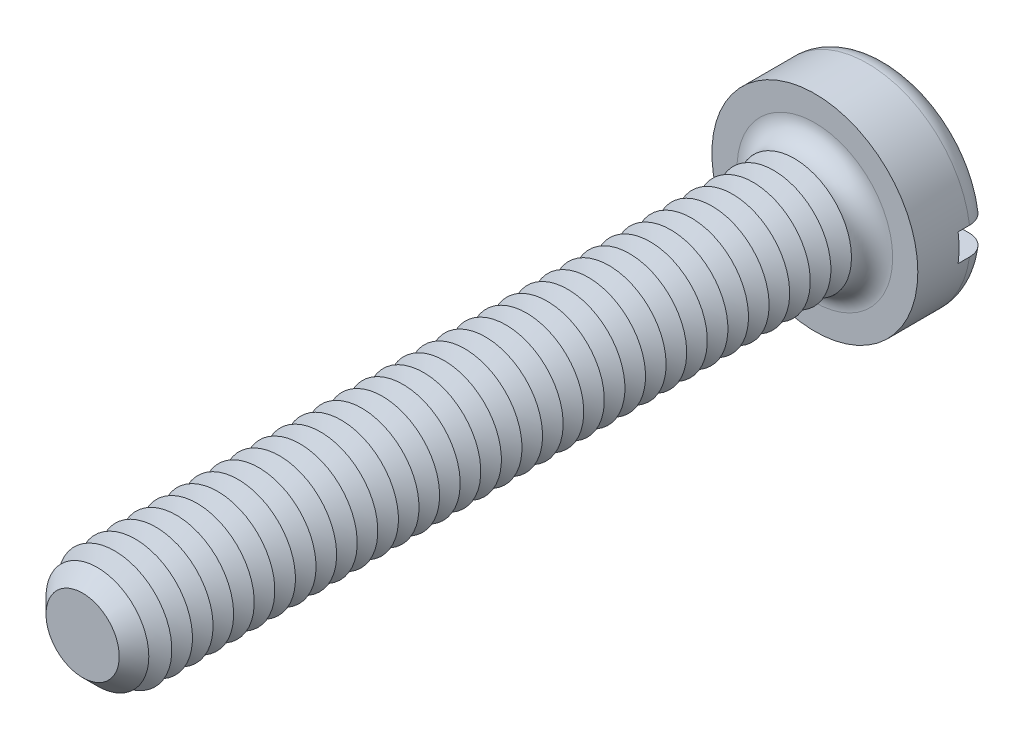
ISO-10303-21;
HEADER;
FILE_DESCRIPTION(('STEP AP214'),'2;1');
FILE_NAME('part.step','',(''),(''),'','','');
FILE_SCHEMA(('AUTOMOTIVE_DESIGN { 1 0 10303 214 1 1 1 1 }'));
ENDSEC;
DATA;
#1=APPLICATION_CONTEXT('core data for automotive mechanical design processes');
#2=APPLICATION_PROTOCOL_DEFINITION('international standard','automotive_design',2000,#1);
#3=PRODUCT_CONTEXT('',#1,'mechanical');
#4=PRODUCT('Part','Part','',(#3));
#5=PRODUCT_RELATED_PRODUCT_CATEGORY('part','',(#4));
#6=PRODUCT_DEFINITION_FORMATION('','',#4);
#7=PRODUCT_DEFINITION_CONTEXT('part definition',#1,'design');
#8=PRODUCT_DEFINITION('design','',#6,#7);
#9=PRODUCT_DEFINITION_SHAPE('','',#8);
#10=(LENGTH_UNIT() NAMED_UNIT(*) SI_UNIT(.MILLI.,.METRE.));
#11=(NAMED_UNIT(*) PLANE_ANGLE_UNIT() SI_UNIT($,.RADIAN.));
#12=(NAMED_UNIT(*) SI_UNIT($,.STERADIAN.) SOLID_ANGLE_UNIT());
#13=UNCERTAINTY_MEASURE_WITH_UNIT(LENGTH_MEASURE(1.E-05),#10,'distance_accuracy_value','');
#14=(GEOMETRIC_REPRESENTATION_CONTEXT(3) GLOBAL_UNCERTAINTY_ASSIGNED_CONTEXT((#13)) GLOBAL_UNIT_ASSIGNED_CONTEXT((#10,
#11,#12)) REPRESENTATION_CONTEXT('',''));
#15=CARTESIAN_POINT('',(0.,0.,0.));
#16=DIRECTION('',(0.,0.,1.));
#17=DIRECTION('',(1.,0.,0.));
#18=AXIS2_PLACEMENT_3D('',#15,#16,#17);
#19=CARTESIAN_POINT('',(0.,0.,-1.6));
#20=DIRECTION('',(0.,0.,1.));
#21=DIRECTION('',(1.,0.,0.));
#22=AXIS2_PLACEMENT_3D('',#19,#20,#21);
#23=PLANE('',#22);
#24=CARTESIAN_POINT('',(0.,0.,-1.6));
#25=DIRECTION('',(0.,0.,1.));
#26=DIRECTION('',(1.,0.,0.));
#27=AXIS2_PLACEMENT_3D('',#24,#25,#26);
#28=CIRCLE('',#27,1.8);
#29=CARTESIAN_POINT('',(-1.77482393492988,0.3,-1.6));
#30=VERTEX_POINT('',#29);
#31=CARTESIAN_POINT('',(1.77482393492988,0.3,-1.6));
#32=VERTEX_POINT('',#31);
#33=EDGE_CURVE('E116',#30,#32,#28,.F.);
#34=ORIENTED_EDGE('',*,*,#33,.T.);
#35=DIRECTION('',(1.,0.,0.));
#36=VECTOR('',#35,1.);
#37=CARTESIAN_POINT('',(-2.25,0.3,-1.6));
#38=LINE('',#37,#36);
#39=EDGE_CURVE('E111',#30,#32,#38,.T.);
#40=ORIENTED_EDGE('',*,*,#39,.F.);
#41=EDGE_LOOP('',(#34,#40));
#42=FACE_BOUND('',#41,.T.);
#43=ADVANCED_FACE('F39',(#42),#23,.F.);
#44=CARTESIAN_POINT('',(0.,0.,-1.15));
#45=DIRECTION('',(0.,0.,1.));
#46=DIRECTION('',(1.,0.,0.));
#47=AXIS2_PLACEMENT_3D('',#44,#45,#46);
#48=TOROIDAL_SURFACE('',#47,1.8,0.45);
#49=CARTESIAN_POINT('',(-2.09367249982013,0.3,-1.4713087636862));
#50=CARTESIAN_POINT('',(-2.07531034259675,0.3,-1.48912990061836));
#51=CARTESIAN_POINT('',(-2.05541605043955,0.3,-1.50540110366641));
#52=CARTESIAN_POINT('',(-2.01315405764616,0.3,-1.53437465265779));
#53=CARTESIAN_POINT('',(-1.99078310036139,0.3,-1.54707221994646));
#54=CARTESIAN_POINT('',(-1.94425163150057,0.3,-1.56853090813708));
#55=CARTESIAN_POINT('',(-1.92009286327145,0.3,-1.57729580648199));
#56=CARTESIAN_POINT('',(-1.8706617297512,0.3,-1.59068015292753));
#57=CARTESIAN_POINT('',(-1.84538964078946,0.3,-1.59530062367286));
#58=CARTESIAN_POINT('',(-1.7942134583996,0.3,-1.60031507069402));
#59=CARTESIAN_POINT('',(-1.76830582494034,0.3,-1.60067291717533));
#60=CARTESIAN_POINT('',(-1.71679040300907,0.3,-1.59707477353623));
#61=CARTESIAN_POINT('',(-1.69118264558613,0.3,-1.59311834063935));
#62=CARTESIAN_POINT('',(-1.64075792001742,0.3,-1.58095464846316));
#63=CARTESIAN_POINT('',(-1.61594989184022,0.3,-1.57271029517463));
#64=CARTESIAN_POINT('',(-1.56806655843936,0.3,-1.55217762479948));
#65=CARTESIAN_POINT('',(-1.54499130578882,0.3,-1.53988918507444));
#66=CARTESIAN_POINT('',(-1.50122413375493,0.3,-1.51158963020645));
#67=CARTESIAN_POINT('',(-1.48053389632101,0.3,-1.49557591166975));
#68=CARTESIAN_POINT('',(-1.44217532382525,0.3,-1.46026359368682));
#69=CARTESIAN_POINT('',(-1.42450683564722,0.3,-1.4409651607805));
#70=CARTESIAN_POINT('',(-1.39293961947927,0.3,-1.39986821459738));
#71=CARTESIAN_POINT('',(-1.37899788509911,0.3,-1.37810275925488));
#72=CARTESIAN_POINT('',(-1.35506190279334,0.3,-1.33249939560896));
#73=CARTESIAN_POINT('',(-1.34506709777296,0.3,-1.30866178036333));
#74=CARTESIAN_POINT('',(-1.3295415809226,0.3,-1.26015137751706));
#75=CARTESIAN_POINT('',(-1.32391771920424,0.3,-1.23550839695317));
#76=CARTESIAN_POINT('',(-1.31696995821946,0.3,-1.18562442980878));
#77=CARTESIAN_POINT('',(-1.31564552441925,0.3,-1.16038351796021));
#78=CARTESIAN_POINT('',(-1.31732714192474,0.3,-1.11049178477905));
#79=CARTESIAN_POINT('',(-1.32025766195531,0.3,-1.08583837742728));
#80=CARTESIAN_POINT('',(-1.3302124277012,0.3,-1.03737369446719));
#81=CARTESIAN_POINT('',(-1.33723664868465,0.3,-1.01356241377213));
#82=CARTESIAN_POINT('',(-1.35515820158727,0.3,-0.967413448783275));
#83=CARTESIAN_POINT('',(-1.36606032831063,0.3,-0.945077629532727));
#84=CARTESIAN_POINT('',(-1.39139351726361,0.3,-0.902507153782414));
#85=CARTESIAN_POINT('',(-1.40582489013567,0.3,-0.882272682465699));
#86=CARTESIAN_POINT('',(-1.43808691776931,0.3,-0.844072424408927));
#87=CARTESIAN_POINT('',(-1.4559757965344,0.3,-0.826155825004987));
#88=CARTESIAN_POINT('',(-1.49445205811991,0.3,-0.793502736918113));
#89=CARTESIAN_POINT('',(-1.51503974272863,0.3,-0.778766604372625));
#90=CARTESIAN_POINT('',(-1.55880475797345,0.3,-0.752571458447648));
#91=CARTESIAN_POINT('',(-1.58202794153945,0.3,-0.741189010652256));
#92=CARTESIAN_POINT('',(-1.63004083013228,0.3,-0.722432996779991));
#93=CARTESIAN_POINT('',(-1.65483064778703,0.3,-0.715059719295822));
#94=CARTESIAN_POINT('',(-1.70558060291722,0.3,-0.704463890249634));
#95=CARTESIAN_POINT('',(-1.73155090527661,0.3,-0.701289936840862));
#96=CARTESIAN_POINT('',(-1.78365633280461,0.3,-0.699350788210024));
#97=CARTESIAN_POINT('',(-1.80979145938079,0.3,-0.700585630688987));
#98=CARTESIAN_POINT('',(-1.86145503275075,0.3,-0.70744393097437));
#99=CARTESIAN_POINT('',(-1.88698403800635,0.3,-0.713063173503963));
#100=CARTESIAN_POINT('',(-1.93672112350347,0.3,-0.728546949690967));
#101=CARTESIAN_POINT('',(-1.96092925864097,0.3,-0.738411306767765));
#102=CARTESIAN_POINT('',(-2.00710191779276,0.3,-0.762015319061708));
#103=CARTESIAN_POINT('',(-2.02908465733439,0.3,-0.775719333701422));
#104=CARTESIAN_POINT('',(-2.0704025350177,0.3,-0.806663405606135));
#105=CARTESIAN_POINT('',(-2.08973782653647,0.3,-0.823903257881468));
#106=CARTESIAN_POINT('',(-2.12497879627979,0.3,-0.861218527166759));
#107=CARTESIAN_POINT('',(-2.1409209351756,0.3,-0.881259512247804));
#108=CARTESIAN_POINT('',(-2.16917502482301,0.3,-0.92375535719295));
#109=CARTESIAN_POINT('',(-2.18148717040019,0.3,-0.946210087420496));
#110=CARTESIAN_POINT('',(-2.20201023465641,0.3,-0.99266079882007));
#111=CARTESIAN_POINT('',(-2.21025973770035,0.3,-1.01663973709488));
#112=CARTESIAN_POINT('',(-2.22258852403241,0.3,-1.06564563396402));
#113=CARTESIAN_POINT('',(-2.22666813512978,0.3,-1.0906725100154));
#114=CARTESIAN_POINT('',(-2.23052418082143,0.3,-1.14090288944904));
#115=CARTESIAN_POINT('',(-2.23032644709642,0.3,-1.16610441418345));
#116=CARTESIAN_POINT('',(-2.22569614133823,0.3,-1.21612212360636));
#117=CARTESIAN_POINT('',(-2.2212625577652,0.3,-1.24093821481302));
#118=CARTESIAN_POINT('',(-2.20829785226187,0.3,-1.2894516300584));
#119=CARTESIAN_POINT('',(-2.19976997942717,0.3,-1.31314982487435));
#120=CARTESIAN_POINT('',(-2.17887390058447,0.3,-1.35876313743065));
#121=CARTESIAN_POINT('',(-2.1665103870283,0.3,-1.3806803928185));
#122=CARTESIAN_POINT('',(-2.14384463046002,0.3,-1.4140108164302));
#123=CARTESIAN_POINT('',(-2.13462949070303,0.3,-1.42617780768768));
#124=CARTESIAN_POINT('',(-2.1150151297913,0.3,-1.44951629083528));
#125=CARTESIAN_POINT('',(-2.10461591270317,0.3,-1.46068778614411));
#126=CARTESIAN_POINT('',(-2.09367249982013,0.3,-1.4713087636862));
#127=B_SPLINE_CURVE_WITH_KNOTS('',3,(#49,#50,#51,#52,#53,#54,#55,#56,#57,#58,#59,#60,#61,#62,
#63,#64,#65,#66,#67,#68,#69,#70,#71,#72,#73,#74,#75,#76,#77,#78,#79,#80,#81,#82,#83,#84,#85,#86,
#87,#88,#89,#90,#91,#92,#93,#94,#95,#96,#97,#98,#99,#100,#101,#102,#103,#104,#105,#106,#107,
#108,#109,#110,#111,#112,#113,#114,#115,#116,#117,#118,#119,#120,#121,#122,#123,#124,#125,#126),
.UNSPECIFIED.,.T.,.F.,(4,2,2,2,2,2,2,2,2,2,2,2,2,2,2,2,2,2,2,2,2,2,2,2,2,2,2,2,2,2,2,2,2,2,2,2,
2,2,4),(0.,0.0767085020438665,0.153519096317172,0.230255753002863,0.306973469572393,
0.384340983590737,0.461716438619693,0.539772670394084,0.617831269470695,0.695944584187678,
0.774053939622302,0.851218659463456,0.928372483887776,1.00383319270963,1.07928451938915,
1.15341274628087,1.22754052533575,1.30176027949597,1.37598656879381,1.45159320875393,
1.52720831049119,1.6044355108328,1.68166826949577,1.75978723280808,1.8379068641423,
1.91595148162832,1.99399285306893,2.07133254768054,2.14866775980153,2.22512456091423,
2.30157725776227,2.3772891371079,2.45299506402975,2.52824391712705,2.60351074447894,
2.67871794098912,2.75383349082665,2.79955010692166,2.84526656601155),.UNSPECIFIED.);
#128=CARTESIAN_POINT('',(-2.22991031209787,0.3,-1.14999999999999));
#129=VERTEX_POINT('',#128);
#130=EDGE_CURVE('E457',#129,#30,#127,.T.);
#131=ORIENTED_EDGE('',*,*,#130,.F.);
#132=CARTESIAN_POINT('',(0.,0.,-1.15));
#133=DIRECTION('',(0.,0.,1.));
#134=DIRECTION('',(1.,0.,0.));
#135=AXIS2_PLACEMENT_3D('',#132,#133,#134);
#136=CIRCLE('',#135,2.25);
#137=CARTESIAN_POINT('',(2.22991031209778,0.3,-1.15));
#138=VERTEX_POINT('',#137);
#139=EDGE_CURVE('E125',#138,#129,#136,.T.);
#140=ORIENTED_EDGE('',*,*,#139,.F.);
#141=CARTESIAN_POINT('',(1.39325818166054,0.3,-1.39903402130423));
#142=CARTESIAN_POINT('',(1.40771723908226,0.3,-1.42030595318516));
#143=CARTESIAN_POINT('',(1.4240122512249,0.3,-1.4403555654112));
#144=CARTESIAN_POINT('',(1.45976320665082,0.3,-1.4774406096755));
#145=CARTESIAN_POINT('',(1.47922380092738,0.3,-1.49447152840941));
#146=CARTESIAN_POINT('',(1.5206923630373,0.3,-1.52502510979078));
#147=CARTESIAN_POINT('',(1.54269721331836,0.3,-1.53855200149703));
#148=CARTESIAN_POINT('',(1.58863815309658,0.3,-1.56176272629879));
#149=CARTESIAN_POINT('',(1.61257369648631,0.3,-1.57144764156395));
#150=CARTESIAN_POINT('',(1.66199169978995,0.3,-1.58680804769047));
#151=CARTESIAN_POINT('',(1.68748839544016,0.3,-1.59243778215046));
#152=CARTESIAN_POINT('',(1.73906656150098,0.3,-1.59934902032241));
#153=CARTESIAN_POINT('',(1.76514807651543,0.3,-1.60063019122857));
#154=CARTESIAN_POINT('',(1.81721740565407,0.3,-1.59879130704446));
#155=CARTESIAN_POINT('',(1.84320486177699,0.3,-1.59566102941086));
#156=CARTESIAN_POINT('',(1.89427635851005,0.3,-1.58504931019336));
#157=CARTESIAN_POINT('',(1.91936042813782,0.3,-1.57756800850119));
#158=CARTESIAN_POINT('',(1.9677137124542,0.3,-1.55851722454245));
#159=CARTESIAN_POINT('',(1.99099484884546,0.3,-1.5469780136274));
#160=CARTESIAN_POINT('',(2.03525897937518,0.3,-1.52011224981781));
#161=CARTESIAN_POINT('',(2.05624211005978,0.3,-1.50478592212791));
#162=CARTESIAN_POINT('',(2.09506403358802,0.3,-1.47096472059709));
#163=CARTESIAN_POINT('',(2.11293536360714,0.3,-1.45250719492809));
#164=CARTESIAN_POINT('',(2.14528563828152,0.3,-1.41282609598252));
#165=CARTESIAN_POINT('',(2.15976477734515,0.3,-1.39160268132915));
#166=CARTESIAN_POINT('',(2.18476262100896,0.3,-1.34723254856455));
#167=CARTESIAN_POINT('',(2.19532119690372,0.3,-1.32410828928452));
#168=CARTESIAN_POINT('',(2.21237438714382,0.3,-1.27640693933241));
#169=CARTESIAN_POINT('',(2.21886918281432,0.3,-1.25182991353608));
#170=CARTESIAN_POINT('',(2.2275687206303,0.3,-1.20210937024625));
#171=CARTESIAN_POINT('',(2.22980376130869,0.3,-1.17697115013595));
#172=CARTESIAN_POINT('',(2.23000940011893,0.3,-1.12667754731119));
#173=CARTESIAN_POINT('',(2.22798009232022,0.3,-1.10152216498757));
#174=CARTESIAN_POINT('',(2.21972856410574,0.3,-1.05197773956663));
#175=CARTESIAN_POINT('',(2.21351744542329,0.3,-1.02758684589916));
#176=CARTESIAN_POINT('',(2.19709696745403,0.3,-0.980190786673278));
#177=CARTESIAN_POINT('',(2.18688760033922,0.3,-0.957185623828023));
#178=CARTESIAN_POINT('',(2.1627435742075,0.3,-0.913157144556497));
#179=CARTESIAN_POINT('',(2.14880093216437,0.3,-0.892138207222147));
#180=CARTESIAN_POINT('',(2.11760640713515,0.3,-0.852719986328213));
#181=CARTESIAN_POINT('',(2.10035443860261,0.3,-0.834320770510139));
#182=CARTESIAN_POINT('',(2.06291254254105,0.3,-0.80052923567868));
#183=CARTESIAN_POINT('',(2.04270386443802,0.3,-0.785157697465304));
#184=CARTESIAN_POINT('',(2.0000139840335,0.3,-0.757986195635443));
#185=CARTESIAN_POINT('',(1.97753267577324,0.3,-0.746186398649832));
#186=CARTESIAN_POINT('',(1.93069507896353,0.3,-0.726364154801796));
#187=CARTESIAN_POINT('',(1.90632219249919,0.3,-0.718380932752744));
#188=CARTESIAN_POINT('',(1.85658993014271,0.3,-0.706569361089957));
#189=CARTESIAN_POINT('',(1.83123049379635,0.3,-0.702741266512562));
#190=CARTESIAN_POINT('',(1.77994107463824,0.3,-0.699306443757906));
#191=CARTESIAN_POINT('',(1.75400788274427,0.3,-0.69974759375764));
#192=CARTESIAN_POINT('',(1.70257608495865,0.3,-0.704939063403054));
#193=CARTESIAN_POINT('',(1.67707750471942,0.3,-0.709689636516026));
#194=CARTESIAN_POINT('',(1.62701662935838,0.3,-0.723419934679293));
#195=CARTESIAN_POINT('',(1.60246387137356,0.3,-0.732434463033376));
#196=CARTESIAN_POINT('',(1.55521886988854,0.3,-0.754458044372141));
#197=CARTESIAN_POINT('',(1.53252668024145,0.3,-0.76746721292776));
#198=CARTESIAN_POINT('',(1.48966925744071,0.3,-0.797124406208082));
#199=CARTESIAN_POINT('',(1.46950315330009,0.3,-0.813771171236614));
#200=CARTESIAN_POINT('',(1.43229728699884,0.3,-0.850255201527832));
#201=CARTESIAN_POINT('',(1.41525734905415,0.3,-0.870092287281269));
#202=CARTESIAN_POINT('',(1.3850470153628,0.3,-0.912123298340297));
#203=CARTESIAN_POINT('',(1.37182821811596,0.3,-0.934282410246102));
#204=CARTESIAN_POINT('',(1.34939737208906,0.3,-0.980542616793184));
#205=CARTESIAN_POINT('',(1.34018456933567,0.3,-1.00464334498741));
#206=CARTESIAN_POINT('',(1.32624172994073,0.3,-1.05352472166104));
#207=CARTESIAN_POINT('',(1.32141599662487,0.3,-1.07827808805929));
#208=CARTESIAN_POINT('',(1.31606478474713,0.3,-1.12825155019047));
#209=CARTESIAN_POINT('',(1.31553992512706,0.3,-1.15347171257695));
#210=CARTESIAN_POINT('',(1.31878307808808,0.3,-1.20323022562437));
#211=CARTESIAN_POINT('',(1.32248353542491,0.3,-1.22777305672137));
#212=CARTESIAN_POINT('',(1.33394086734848,0.3,-1.27586981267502));
#213=CARTESIAN_POINT('',(1.34169274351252,0.3,-1.2994249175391));
#214=CARTESIAN_POINT('',(1.35704250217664,0.3,-1.33561898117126));
#215=CARTESIAN_POINT('',(1.36341395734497,0.3,-1.34879219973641));
#216=CARTESIAN_POINT('',(1.37741190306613,0.3,-1.37445328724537));
#217=CARTESIAN_POINT('',(1.38503837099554,0.3,-1.38694116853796));
#218=CARTESIAN_POINT('',(1.39325818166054,0.3,-1.39903402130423));
#219=B_SPLINE_CURVE_WITH_KNOTS('',3,(#141,#142,#143,#144,#145,#146,#147,#148,#149,#150,#151,
#152,#153,#154,#155,#156,#157,#158,#159,#160,#161,#162,#163,#164,#165,#166,#167,#168,#169,#170,
#171,#172,#173,#174,#175,#176,#177,#178,#179,#180,#181,#182,#183,#184,#185,#186,#187,#188,#189,
#190,#191,#192,#193,#194,#195,#196,#197,#198,#199,#200,#201,#202,#203,#204,#205,#206,#207,#208,
#209,#210,#211,#212,#213,#214,#215,#216,#217,#218),.UNSPECIFIED.,.T.,.F.,(4,2,2,2,2,2,2,2,2,2,2,
2,2,2,2,2,2,2,2,2,2,2,2,2,2,2,2,2,2,2,2,2,2,2,2,2,2,2,4),(0.,0.0771077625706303,
0.154329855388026,0.231458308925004,0.308565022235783,0.386528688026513,0.464498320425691,
0.542648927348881,0.620797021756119,0.698374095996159,0.77594655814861,0.852651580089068,
0.929352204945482,1.00524992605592,1.08114426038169,1.15649673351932,1.2318475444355,
1.30699910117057,1.38215080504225,1.45746451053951,1.53278016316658,1.60859599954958,
1.68441537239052,1.76099806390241,1.83758545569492,1.91503273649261,1.99248457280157,
2.07057979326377,2.14867727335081,2.22674775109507,2.30481383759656,2.38184276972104,
2.45885719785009,2.53414829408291,2.6094502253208,2.68356487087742,2.75758829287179,
2.80142397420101,2.84525886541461),.UNSPECIFIED.);
#220=EDGE_CURVE('E459',#32,#138,#219,.T.);
#221=ORIENTED_EDGE('',*,*,#220,.F.);
#222=ORIENTED_EDGE('',*,*,#33,.F.);
#223=EDGE_LOOP('',(#131,#140,#221,#222));
#224=FACE_BOUND('',#223,.T.);
#225=ADVANCED_FACE('F441',(#224),#48,.T.);
#226=CARTESIAN_POINT('',(0.,0.,-1.6));
#227=DIRECTION('',(0.,0.,1.));
#228=DIRECTION('',(1.,0.,0.));
#229=AXIS2_PLACEMENT_3D('',#226,#227,#228);
#230=CYLINDRICAL_SURFACE('',#229,2.25);
#231=DIRECTION('',(0.,0.,1.));
#232=VECTOR('',#231,1.);
#233=CARTESIAN_POINT('',(2.22991031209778,0.3,-1.6));
#234=LINE('',#233,#232);
#235=CARTESIAN_POINT('',(2.22991031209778,0.3,-0.9));
#236=VERTEX_POINT('',#235);
#237=EDGE_CURVE('E474',#138,#236,#234,.T.);
#238=ORIENTED_EDGE('',*,*,#237,.F.);
#239=ORIENTED_EDGE('',*,*,#139,.T.);
#240=DIRECTION('',(0.,0.,1.));
#241=VECTOR('',#240,1.);
#242=CARTESIAN_POINT('',(-2.22991031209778,0.3,-1.6));
#243=LINE('',#242,#241);
#244=CARTESIAN_POINT('',(-2.22991031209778,0.3,-0.9));
#245=VERTEX_POINT('',#244);
#246=EDGE_CURVE('E63',#245,#129,#243,.F.);
#247=ORIENTED_EDGE('',*,*,#246,.F.);
#248=CARTESIAN_POINT('',(0.,0.,-0.9));
#249=DIRECTION('',(0.,0.,-1.));
#250=DIRECTION('',(-1.,0.,0.));
#251=AXIS2_PLACEMENT_3D('',#248,#249,#250);
#252=CIRCLE('',#251,2.25);
#253=CARTESIAN_POINT('',(-2.22991031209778,-0.3,-0.9));
#254=VERTEX_POINT('',#253);
#255=EDGE_CURVE('E43',#245,#254,#252,.F.);
#256=ORIENTED_EDGE('',*,*,#255,.T.);
#257=DIRECTION('',(0.,0.,1.));
#258=VECTOR('',#257,1.);
#259=CARTESIAN_POINT('',(-2.22991031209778,-0.3,-1.6));
#260=LINE('',#259,#258);
#261=CARTESIAN_POINT('',(-2.22991031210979,-0.3,-1.15000000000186));
#262=VERTEX_POINT('',#261);
#263=EDGE_CURVE('E471',#262,#254,#260,.T.);
#264=ORIENTED_EDGE('',*,*,#263,.F.);
#265=CARTESIAN_POINT('',(2.22991031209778,-0.3,-1.15));
#266=VERTEX_POINT('',#265);
#267=EDGE_CURVE('E127',#262,#266,#136,.T.);
#268=ORIENTED_EDGE('',*,*,#267,.T.);
#269=DIRECTION('',(0.,0.,1.));
#270=VECTOR('',#269,1.);
#271=CARTESIAN_POINT('',(2.22991031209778,-0.3,-1.6));
#272=LINE('',#271,#270);
#273=CARTESIAN_POINT('',(2.22991031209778,-0.3,-0.9));
#274=VERTEX_POINT('',#273);
#275=EDGE_CURVE('E55',#274,#266,#272,.F.);
#276=ORIENTED_EDGE('',*,*,#275,.F.);
#277=EDGE_CURVE('E11',#274,#236,#252,.F.);
#278=ORIENTED_EDGE('',*,*,#277,.T.);
#279=EDGE_LOOP('',(#238,#239,#247,#256,#264,#268,#276,#278));
#280=FACE_BOUND('',#279,.T.);
#281=CARTESIAN_POINT('',(0.,0.,0.));
#282=DIRECTION('',(0.,0.,1.));
#283=DIRECTION('',(1.,0.,0.));
#284=AXIS2_PLACEMENT_3D('',#281,#282,#283);
#285=CIRCLE('',#284,2.25);
#286=CARTESIAN_POINT('',(2.25,0.,0.));
#287=VERTEX_POINT('',#286);
#288=EDGE_CURVE('E477',#287,#287,#285,.T.);
#289=ORIENTED_EDGE('',*,*,#288,.F.);
#290=EDGE_LOOP('',(#289));
#291=FACE_BOUND('',#290,.T.);
#292=ADVANCED_FACE('F437',(#280,#291),#230,.T.);
#293=CARTESIAN_POINT('',(1.77482393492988,-0.3,-1.6));
#294=VERTEX_POINT('',#293);
#295=CARTESIAN_POINT('',(-1.77482393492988,-0.3,-1.6));
#296=VERTEX_POINT('',#295);
#297=EDGE_CURVE('E109',#294,#296,#28,.F.);
#298=ORIENTED_EDGE('',*,*,#297,.T.);
#299=DIRECTION('',(-1.,0.,0.));
#300=VECTOR('',#299,1.);
#301=CARTESIAN_POINT('',(-2.25,-0.3,-1.6));
#302=LINE('',#301,#300);
#303=EDGE_CURVE('E96',#294,#296,#302,.T.);
#304=ORIENTED_EDGE('',*,*,#303,.F.);
#305=EDGE_LOOP('',(#298,#304));
#306=FACE_BOUND('',#305,.T.);
#307=ADVANCED_FACE('F108',(#306),#23,.F.);
#308=CARTESIAN_POINT('',(0.,0.,0.));
#309=DIRECTION('',(0.,0.,1.));
#310=DIRECTION('',(1.,0.,0.));
#311=AXIS2_PLACEMENT_3D('',#308,#309,#310);
#312=PLANE('',#311);
#313=CARTESIAN_POINT('',(0.,0.,0.));
#314=DIRECTION('',(0.,0.,1.));
#315=DIRECTION('',(1.,0.,0.));
#316=AXIS2_PLACEMENT_3D('',#313,#314,#315);
#317=CIRCLE('',#316,1.7);
#318=CARTESIAN_POINT('',(1.7,0.,0.));
#319=VERTEX_POINT('',#318);
#320=EDGE_CURVE('E115',#319,#319,#317,.F.);
#321=ORIENTED_EDGE('',*,*,#320,.T.);
#322=EDGE_LOOP('',(#321));
#323=FACE_BOUND('',#322,.T.);
#324=ORIENTED_EDGE('',*,*,#288,.T.);
#325=EDGE_LOOP('',(#324));
#326=FACE_BOUND('',#325,.T.);
#327=ADVANCED_FACE('F436',(#323,#326),#312,.T.);
#328=CARTESIAN_POINT('',(-2.09367249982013,-0.3,-1.4713087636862));
#329=CARTESIAN_POINT('',(-2.11176539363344,-0.3,-1.45374579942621));
#330=CARTESIAN_POINT('',(-2.1283968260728,-0.3,-1.43465254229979));
#331=CARTESIAN_POINT('',(-2.15823692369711,-0.3,-1.39393307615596));
#332=CARTESIAN_POINT('',(-2.17144184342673,-0.3,-1.37230413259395));
#333=CARTESIAN_POINT('',(-2.19402281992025,-0.3,-1.32713362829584));
#334=CARTESIAN_POINT('',(-2.20339951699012,-0.3,-1.30359238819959));
#335=CARTESIAN_POINT('',(-2.21804409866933,-0.3,-1.25527081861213));
#336=CARTESIAN_POINT('',(-2.22331295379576,-0.3,-1.23049078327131));
#337=CARTESIAN_POINT('',(-2.22957448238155,-0.3,-1.18050893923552));
#338=CARTESIAN_POINT('',(-2.23058617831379,-0.3,-1.15530951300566));
#339=CARTESIAN_POINT('',(-2.22835535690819,-0.3,-1.10509920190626));
#340=CARTESIAN_POINT('',(-2.22511277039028,-0.3,-1.08008832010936));
#341=CARTESIAN_POINT('',(-2.21448018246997,-0.3,-1.03101646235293));
#342=CARTESIAN_POINT('',(-2.20709836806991,-0.3,-1.00695371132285));
#343=CARTESIAN_POINT('',(-2.18841075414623,-0.3,-0.960404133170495));
#344=CARTESIAN_POINT('',(-2.17710493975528,-0.3,-0.937917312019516));
#345=CARTESIAN_POINT('',(-2.15086234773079,-0.3,-0.895085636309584));
#346=CARTESIAN_POINT('',(-2.13591537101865,-0.3,-0.874747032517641));
#347=CARTESIAN_POINT('',(-2.1028415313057,-0.3,-0.836845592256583));
#348=CARTESIAN_POINT('',(-2.08471458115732,-0.3,-0.819282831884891));
#349=CARTESIAN_POINT('',(-2.0456590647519,-0.3,-0.78729174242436));
#350=CARTESIAN_POINT('',(-2.0247112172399,-0.3,-0.772886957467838));
#351=CARTESIAN_POINT('',(-1.98071452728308,-0.3,-0.747756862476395));
#352=CARTESIAN_POINT('',(-1.95766557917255,-0.3,-0.737031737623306));
#353=CARTESIAN_POINT('',(-1.90986554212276,-0.3,-0.71944451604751));
#354=CARTESIAN_POINT('',(-1.88509923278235,-0.3,-0.712623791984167));
#355=CARTESIAN_POINT('',(-1.83477837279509,-0.3,-0.703186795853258));
#356=CARTESIAN_POINT('',(-1.80922377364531,-0.3,-0.700570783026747));
#357=CARTESIAN_POINT('',(-1.75774893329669,-0.3,-0.699591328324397));
#358=CARTESIAN_POINT('',(-1.73182778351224,-0.3,-0.701275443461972));
#359=CARTESIAN_POINT('',(-1.68062744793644,-0.3,-0.708937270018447));
#360=CARTESIAN_POINT('',(-1.65534829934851,-0.3,-0.714915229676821));
#361=CARTESIAN_POINT('',(-1.6059539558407,-0.3,-0.731056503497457));
#362=CARTESIAN_POINT('',(-1.58184881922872,-0.3,-0.741250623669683));
#363=CARTESIAN_POINT('',(-1.53569497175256,-0.3,-0.765548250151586));
#364=CARTESIAN_POINT('',(-1.51364629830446,-0.3,-0.779651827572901));
#365=CARTESIAN_POINT('',(-1.47229470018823,-0.3,-0.811355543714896));
#366=CARTESIAN_POINT('',(-1.45298625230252,-0.3,-0.828948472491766));
#367=CARTESIAN_POINT('',(-1.41765142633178,-0.3,-0.867170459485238));
#368=CARTESIAN_POINT('',(-1.40162480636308,-0.3,-0.887799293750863));
#369=CARTESIAN_POINT('',(-1.37358365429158,-0.3,-0.93118317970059));
#370=CARTESIAN_POINT('',(-1.3615121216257,-0.3,-0.953901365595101));
#371=CARTESIAN_POINT('',(-1.34145576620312,-0.3,-1.00107529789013));
#372=CARTESIAN_POINT('',(-1.33347032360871,-0.3,-1.02553078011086));
#373=CARTESIAN_POINT('',(-1.32199536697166,-0.3,-1.07489401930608));
#374=CARTESIAN_POINT('',(-1.31840873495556,-0.3,-1.09977921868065));
#375=CARTESIAN_POINT('',(-1.31553052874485,-0.3,-1.1497957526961));
#376=CARTESIAN_POINT('',(-1.31623852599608,-0.3,-1.17492706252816));
#377=CARTESIAN_POINT('',(-1.32188368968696,-0.3,-1.22435119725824));
#378=CARTESIAN_POINT('',(-1.32676151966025,-0.3,-1.24865083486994));
#379=CARTESIAN_POINT('',(-1.34050334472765,-0.3,-1.29609421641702));
#380=CARTESIAN_POINT('',(-1.34936742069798,-0.3,-1.31923793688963));
#381=CARTESIAN_POINT('',(-1.37086295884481,-0.3,-1.36387796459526));
#382=CARTESIAN_POINT('',(-1.38351729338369,-0.3,-1.38536324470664));
#383=CARTESIAN_POINT('',(-1.41218367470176,-0.3,-1.42596199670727));
#384=CARTESIAN_POINT('',(-1.42819606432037,-0.3,-1.44507522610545));
#385=CARTESIAN_POINT('',(-1.46347664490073,-0.3,-1.48081087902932));
#386=CARTESIAN_POINT('',(-1.48280543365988,-0.3,-1.49737347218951));
#387=CARTESIAN_POINT('',(-1.5239232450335,-0.3,-1.52709508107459));
#388=CARTESIAN_POINT('',(-1.54571253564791,-0.3,-1.54025372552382));
#389=CARTESIAN_POINT('',(-1.59160097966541,-0.3,-1.56305446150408));
#390=CARTESIAN_POINT('',(-1.61573734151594,-0.3,-1.57262172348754));
#391=CARTESIAN_POINT('',(-1.66526504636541,-0.3,-1.58760700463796));
#392=CARTESIAN_POINT('',(-1.69065641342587,-0.3,-1.59302494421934));
#393=CARTESIAN_POINT('',(-1.74220154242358,-0.3,-1.59958446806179));
#394=CARTESIAN_POINT('',(-1.7683598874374,-0.3,-1.60069012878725));
#395=CARTESIAN_POINT('',(-1.82049681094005,-0.3,-1.59847888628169));
#396=CARTESIAN_POINT('',(-1.8464753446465,-0.3,-1.59516091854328));
#397=CARTESIAN_POINT('',(-1.89742078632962,-0.3,-1.58419269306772));
#398=CARTESIAN_POINT('',(-1.92239041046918,-0.3,-1.57655503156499));
#399=CARTESIAN_POINT('',(-1.97064988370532,-0.3,-1.55715679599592));
#400=CARTESIAN_POINT('',(-1.99394179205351,-0.3,-1.54540138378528));
#401=CARTESIAN_POINT('',(-2.03003215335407,-0.3,-1.52312594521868));
#402=CARTESIAN_POINT('',(-2.04354254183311,-0.3,-1.51373809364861));
#403=CARTESIAN_POINT('',(-2.06946640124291,-0.3,-1.49355310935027));
#404=CARTESIAN_POINT('',(-2.08187987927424,-0.3,-1.48275598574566));
#405=CARTESIAN_POINT('',(-2.09367249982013,-0.3,-1.4713087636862));
#406=B_SPLINE_CURVE_WITH_KNOTS('',3,(#328,#329,#330,#331,#332,#333,#334,#335,#336,#337,#338,
#339,#340,#341,#342,#343,#344,#345,#346,#347,#348,#349,#350,#351,#352,#353,#354,#355,#356,#357,
#358,#359,#360,#361,#362,#363,#364,#365,#366,#367,#368,#369,#370,#371,#372,#373,#374,#375,#376,
#377,#378,#379,#380,#381,#382,#383,#384,#385,#386,#387,#388,#389,#390,#391,#392,#393,#394,#395,
#396,#397,#398,#399,#400,#401,#402,#403,#404,#405),.UNSPECIFIED.,.T.,.F.,(4,2,2,2,2,2,2,2,2,2,2,
2,2,2,2,2,2,2,2,2,2,2,2,2,2,2,2,2,2,2,2,2,2,2,2,2,2,2,4),(0.,0.0755864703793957,
0.151255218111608,0.226911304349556,0.302549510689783,0.377849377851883,0.453150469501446,
0.528303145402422,0.603456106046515,0.67882204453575,0.754190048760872,0.83010216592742,
0.906018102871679,0.982724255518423,1.05943513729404,1.13699806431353,1.21456547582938,
1.29270994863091,1.37085584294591,1.44884191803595,1.52682224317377,1.60362346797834,
1.68041303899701,1.75547480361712,1.83052907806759,1.90453278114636,1.97853798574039,
2.05299909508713,2.12746781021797,2.20347986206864,2.27950020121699,2.3570265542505,
2.43455439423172,2.5127267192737,2.59091785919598,2.66888216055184,2.74674907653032,
2.79601528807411,2.84528118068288),.UNSPECIFIED.);
#407=EDGE_CURVE('E103',#296,#262,#406,.T.);
#408=ORIENTED_EDGE('',*,*,#407,.F.);
#409=ORIENTED_EDGE('',*,*,#297,.F.);
#410=CARTESIAN_POINT('',(1.39325818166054,-0.3,-1.39903402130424));
#411=CARTESIAN_POINT('',(1.37924349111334,-0.3,-1.37841200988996));
#412=CARTESIAN_POINT('',(1.36693374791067,-0.3,-1.35661225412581));
#413=CARTESIAN_POINT('',(1.34612289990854,-0.3,-1.31124547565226));
#414=CARTESIAN_POINT('',(1.33762533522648,-0.3,-1.28767683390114));
#415=CARTESIAN_POINT('',(1.32472877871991,-0.3,-1.23943261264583));
#416=CARTESIAN_POINT('',(1.3203309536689,-0.3,-1.21475672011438));
#417=CARTESIAN_POINT('',(1.31579198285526,-0.3,-1.16502199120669));
#418=CARTESIAN_POINT('',(1.31564980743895,-0.3,-1.13996324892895));
#419=CARTESIAN_POINT('',(1.31960322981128,-0.3,-1.09044336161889));
#420=CARTESIAN_POINT('',(1.32365524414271,-0.3,-1.06597872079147));
#421=CARTESIAN_POINT('',(1.33579339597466,-0.3,-1.01807218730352));
#422=CARTESIAN_POINT('',(1.34387971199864,-0.3,-0.994630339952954));
#423=CARTESIAN_POINT('',(1.36386460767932,-0.3,-0.949319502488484));
#424=CARTESIAN_POINT('',(1.37577869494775,-0.3,-0.92745736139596));
#425=CARTESIAN_POINT('',(1.40303929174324,-0.3,-0.885990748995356));
#426=CARTESIAN_POINT('',(1.41838612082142,-0.3,-0.866386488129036));
#427=CARTESIAN_POINT('',(1.45239955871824,-0.3,-0.829572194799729));
#428=CARTESIAN_POINT('',(1.47112624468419,-0.3,-0.812417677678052));
#429=CARTESIAN_POINT('',(1.51114353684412,-0.3,-0.78141873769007));
#430=CARTESIAN_POINT('',(1.53243442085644,-0.3,-0.767574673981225));
#431=CARTESIAN_POINT('',(1.57744959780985,-0.3,-0.743302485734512));
#432=CARTESIAN_POINT('',(1.6012148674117,-0.3,-0.732950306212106));
#433=CARTESIAN_POINT('',(1.65013556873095,-0.3,-0.71633816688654));
#434=CARTESIAN_POINT('',(1.67529109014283,-0.3,-0.710078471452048));
#435=CARTESIAN_POINT('',(1.72654223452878,-0.3,-0.701786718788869));
#436=CARTESIAN_POINT('',(1.75264462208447,-0.3,-0.699796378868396));
#437=CARTESIAN_POINT('',(1.80481283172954,-0.3,-0.700236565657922));
#438=CARTESIAN_POINT('',(1.83087865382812,-0.3,-0.702667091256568));
#439=CARTESIAN_POINT('',(1.88216421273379,-0.3,-0.71188843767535));
#440=CARTESIAN_POINT('',(1.90738581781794,-0.3,-0.718668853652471));
#441=CARTESIAN_POINT('',(1.95631449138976,-0.3,-0.736408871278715));
#442=CARTESIAN_POINT('',(1.98002162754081,-0.3,-0.747368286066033));
#443=CARTESIAN_POINT('',(2.02500221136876,-0.3,-0.773046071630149));
#444=CARTESIAN_POINT('',(2.04629687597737,-0.3,-0.78772726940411));
#445=CARTESIAN_POINT('',(2.08608258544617,-0.3,-0.820494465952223));
#446=CARTESIAN_POINT('',(2.10457379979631,-0.3,-0.838580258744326));
#447=CARTESIAN_POINT('',(2.1380062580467,-0.3,-0.877422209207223));
#448=CARTESIAN_POINT('',(2.15298532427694,-0.3,-0.898145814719));
#449=CARTESIAN_POINT('',(2.17921311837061,-0.3,-0.941832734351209));
#450=CARTESIAN_POINT('',(2.19046204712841,-0.3,-0.964795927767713));
#451=CARTESIAN_POINT('',(2.20880507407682,-0.3,-1.01207981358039));
#452=CARTESIAN_POINT('',(2.2159367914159,-0.3,-1.0363859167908));
#453=CARTESIAN_POINT('',(2.22599386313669,-0.3,-1.08585317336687));
#454=CARTESIAN_POINT('',(2.22891936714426,-0.3,-1.11101429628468));
#455=CARTESIAN_POINT('',(2.23047255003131,-0.3,-1.16133395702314));
#456=CARTESIAN_POINT('',(2.22912306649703,-0.3,-1.18649179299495));
#457=CARTESIAN_POINT('',(2.22221641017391,-0.3,-1.236222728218));
#458=CARTESIAN_POINT('',(2.21665928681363,-0.3,-1.26079583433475));
#459=CARTESIAN_POINT('',(2.20150655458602,-0.3,-1.30864604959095));
#460=CARTESIAN_POINT('',(2.19191347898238,-0.3,-1.3319239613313));
#461=CARTESIAN_POINT('',(2.16897085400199,-0.3,-1.37654778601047));
#462=CARTESIAN_POINT('',(2.15562126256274,-0.3,-1.39789367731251));
#463=CARTESIAN_POINT('',(2.12549147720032,-0.3,-1.43814583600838));
#464=CARTESIAN_POINT('',(2.1086973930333,-0.3,-1.45704170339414));
#465=CARTESIAN_POINT('',(2.07219852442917,-0.3,-1.491773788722));
#466=CARTESIAN_POINT('',(2.0524936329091,-0.3,-1.50760989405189));
#467=CARTESIAN_POINT('',(2.01056127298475,-0.3,-1.53591667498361));
#468=CARTESIAN_POINT('',(1.98831430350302,-0.3,-1.54835845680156));
#469=CARTESIAN_POINT('',(1.94206418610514,-0.3,-1.5693763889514));
#470=CARTESIAN_POINT('',(1.91806093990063,-0.3,-1.57795232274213));
#471=CARTESIAN_POINT('',(1.86869953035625,-0.3,-1.5910955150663));
#472=CARTESIAN_POINT('',(1.84332941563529,-0.3,-1.59561788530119));
#473=CARTESIAN_POINT('',(1.7921914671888,-0.3,-1.60038767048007));
#474=CARTESIAN_POINT('',(1.76642362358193,-0.3,-1.60063497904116));
#475=CARTESIAN_POINT('',(1.71493241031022,-0.3,-1.59684388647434));
#476=CARTESIAN_POINT('',(1.6892123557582,-0.3,-1.59276040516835));
#477=CARTESIAN_POINT('',(1.63880694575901,-0.3,-1.58035661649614));
#478=CARTESIAN_POINT('',(1.61412189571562,-0.3,-1.5720350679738));
#479=CARTESIAN_POINT('',(1.56635013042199,-0.3,-1.55132424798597));
#480=CARTESIAN_POINT('',(1.54327365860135,-0.3,-1.53891136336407));
#481=CARTESIAN_POINT('',(1.49956705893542,-0.3,-1.51037484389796));
#482=CARTESIAN_POINT('',(1.478934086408,-0.3,-1.49425558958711));
#483=CARTESIAN_POINT('',(1.44732882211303,-0.3,-1.46489751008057));
#484=CARTESIAN_POINT('',(1.43548118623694,-0.3,-1.45258668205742));
#485=CARTESIAN_POINT('',(1.41324217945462,-0.3,-1.42671249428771));
#486=CARTESIAN_POINT('',(1.40285079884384,-0.3,-1.41314914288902));
#487=CARTESIAN_POINT('',(1.39325818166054,-0.3,-1.39903402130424));
#488=B_SPLINE_CURVE_WITH_KNOTS('',3,(#410,#411,#412,#413,#414,#415,#416,#417,#418,#419,#420,
#421,#422,#423,#424,#425,#426,#427,#428,#429,#430,#431,#432,#433,#434,#435,#436,#437,#438,#439,
#440,#441,#442,#443,#444,#445,#446,#447,#448,#449,#450,#451,#452,#453,#454,#455,#456,#457,#458,
#459,#460,#461,#462,#463,#464,#465,#466,#467,#468,#469,#470,#471,#472,#473,#474,#475,#476,#477,
#478,#479,#480,#481,#482,#483,#484,#485,#486,#487),.UNSPECIFIED.,.T.,.F.,(4,2,2,2,2,2,2,2,2,2,2,
2,2,2,2,2,2,2,2,2,2,2,2,2,2,2,2,2,2,2,2,2,2,2,2,2,2,2,4),(0.,0.0747398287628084,
0.149548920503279,0.224379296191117,0.29919156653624,0.373234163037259,0.447280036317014,
0.521629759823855,0.595986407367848,0.671825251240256,0.747672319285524,0.825076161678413,
0.902485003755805,0.980646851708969,1.05880868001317,1.13678424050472,1.21475631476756,
1.29197834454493,1.36919570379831,1.44553881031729,1.52187780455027,1.59750777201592,
1.67313504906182,1.74835899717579,1.82358206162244,1.89875798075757,1.97393474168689,
2.04942084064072,2.12490971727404,2.20102244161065,2.27713942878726,2.35408926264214,
2.43104101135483,2.50880170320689,2.58658518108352,2.66482568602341,2.74297419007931,
2.79413160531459,2.84528867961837),.UNSPECIFIED.);
#489=EDGE_CURVE('E92',#266,#294,#488,.T.);
#490=ORIENTED_EDGE('',*,*,#489,.F.);
#491=ORIENTED_EDGE('',*,*,#267,.F.);
#492=EDGE_LOOP('',(#408,#409,#490,#491));
#493=FACE_BOUND('',#492,.T.);
#494=ADVANCED_FACE('F113',(#493),#48,.T.);
#495=CARTESIAN_POINT('',(0.,0.,0.450000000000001));
#496=DIRECTION('',(0.,0.,1.));
#497=DIRECTION('',(1.,0.,0.));
#498=AXIS2_PLACEMENT_3D('',#495,#496,#497);
#499=TOROIDAL_SURFACE('',#498,1.7,0.45);
#500=ORIENTED_EDGE('',*,*,#320,.F.);
#501=EDGE_LOOP('',(#500));
#502=FACE_BOUND('',#501,.T.);
#503=CARTESIAN_POINT('',(0.,0.,0.450000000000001));
#504=DIRECTION('',(0.,0.,-1.));
#505=DIRECTION('',(-1.,0.,0.));
#506=AXIS2_PLACEMENT_3D('',#503,#504,#505);
#507=CIRCLE('',#506,1.25);
#508=CARTESIAN_POINT('',(-1.25,0.,0.450000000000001));
#509=VERTEX_POINT('',#508);
#510=EDGE_CURVE('E483',#509,#509,#507,.T.);
#511=ORIENTED_EDGE('',*,*,#510,.T.);
#512=EDGE_LOOP('',(#511));
#513=FACE_BOUND('',#512,.T.);
#514=ADVANCED_FACE('F429',(#502,#513),#499,.F.);
#515=CARTESIAN_POINT('',(0.,0.,0.675000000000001));
#516=DIRECTION('',(0.,0.,-1.));
#517=DIRECTION('',(-1.,0.,0.));
#518=AXIS2_PLACEMENT_3D('',#515,#516,#517);
#519=CONICAL_SURFACE('',#518,0.860288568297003,1.0471975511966);
#520=ORIENTED_EDGE('',*,*,#510,.F.);
#521=EDGE_LOOP('',(#520));
#522=FACE_BOUND('',#521,.T.);
#523=CARTESIAN_POINT('',(0.,0.,0.675000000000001));
#524=DIRECTION('',(0.,0.,-1.));
#525=DIRECTION('',(-1.,0.,0.));
#526=AXIS2_PLACEMENT_3D('',#523,#524,#525);
#527=CIRCLE('',#526,0.860288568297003);
#528=CARTESIAN_POINT('',(-0.860288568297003,0.,0.675000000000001));
#529=VERTEX_POINT('',#528);
#530=EDGE_CURVE('E490',#529,#529,#527,.T.);
#531=ORIENTED_EDGE('',*,*,#530,.T.);
#532=EDGE_LOOP('',(#531));
#533=FACE_BOUND('',#532,.T.);
#534=ADVANCED_FACE('F425',(#522,#533),#519,.T.);
#535=CARTESIAN_POINT('',(0.,0.,0.900000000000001));
#536=DIRECTION('',(0.,0.,1.));
#537=DIRECTION('',(1.,0.,0.));
#538=AXIS2_PLACEMENT_3D('',#535,#536,#537);
#539=CONICAL_SURFACE('',#538,1.25,1.0471975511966);
#540=ORIENTED_EDGE('',*,*,#530,.F.);
#541=EDGE_LOOP('',(#540));
#542=FACE_BOUND('',#541,.T.);
#543=CARTESIAN_POINT('',(0.,0.,0.900000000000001));
#544=DIRECTION('',(0.,0.,-1.));
#545=DIRECTION('',(-1.,0.,0.));
#546=AXIS2_PLACEMENT_3D('',#543,#544,#545);
#547=CIRCLE('',#546,1.25);
#548=CARTESIAN_POINT('',(-1.25,0.,0.900000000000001));
#549=VERTEX_POINT('',#548);
#550=EDGE_CURVE('E496',#549,#549,#547,.T.);
#551=ORIENTED_EDGE('',*,*,#550,.T.);
#552=EDGE_LOOP('',(#551));
#553=FACE_BOUND('',#552,.T.);
#554=ADVANCED_FACE('F421',(#542,#553),#539,.T.);
#555=CARTESIAN_POINT('',(0.,0.,1.125));
#556=DIRECTION('',(0.,0.,-1.));
#557=DIRECTION('',(-1.,0.,0.));
#558=AXIS2_PLACEMENT_3D('',#555,#556,#557);
#559=CONICAL_SURFACE('',#558,0.860288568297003,1.0471975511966);
#560=ORIENTED_EDGE('',*,*,#550,.F.);
#561=EDGE_LOOP('',(#560));
#562=FACE_BOUND('',#561,.T.);
#563=CARTESIAN_POINT('',(0.,0.,1.125));
#564=DIRECTION('',(0.,0.,-1.));
#565=DIRECTION('',(-1.,0.,0.));
#566=AXIS2_PLACEMENT_3D('',#563,#564,#565);
#567=CIRCLE('',#566,0.860288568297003);
#568=CARTESIAN_POINT('',(-0.860288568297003,0.,1.125));
#569=VERTEX_POINT('',#568);
#570=EDGE_CURVE('E500',#569,#569,#567,.T.);
#571=ORIENTED_EDGE('',*,*,#570,.T.);
#572=EDGE_LOOP('',(#571));
#573=FACE_BOUND('',#572,.T.);
#574=ADVANCED_FACE('F417',(#562,#573),#559,.T.);
#575=CARTESIAN_POINT('',(0.,0.,1.35));
#576=DIRECTION('',(0.,0.,1.));
#577=DIRECTION('',(1.,0.,0.));
#578=AXIS2_PLACEMENT_3D('',#575,#576,#577);
#579=CONICAL_SURFACE('',#578,1.25,1.0471975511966);
#580=ORIENTED_EDGE('',*,*,#570,.F.);
#581=EDGE_LOOP('',(#580));
#582=FACE_BOUND('',#581,.T.);
#583=CARTESIAN_POINT('',(0.,0.,1.35));
#584=DIRECTION('',(0.,0.,-1.));
#585=DIRECTION('',(-1.,0.,0.));
#586=AXIS2_PLACEMENT_3D('',#583,#584,#585);
#587=CIRCLE('',#586,1.25);
#588=CARTESIAN_POINT('',(-1.25,0.,1.35));
#589=VERTEX_POINT('',#588);
#590=EDGE_CURVE('E504',#589,#589,#587,.T.);
#591=ORIENTED_EDGE('',*,*,#590,.T.);
#592=EDGE_LOOP('',(#591));
#593=FACE_BOUND('',#592,.T.);
#594=ADVANCED_FACE('F413',(#582,#593),#579,.T.);
#595=CARTESIAN_POINT('',(0.,0.,1.575));
#596=DIRECTION('',(0.,0.,-1.));
#597=DIRECTION('',(-1.,0.,0.));
#598=AXIS2_PLACEMENT_3D('',#595,#596,#597);
#599=CONICAL_SURFACE('',#598,0.860288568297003,1.0471975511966);
#600=ORIENTED_EDGE('',*,*,#590,.F.);
#601=EDGE_LOOP('',(#600));
#602=FACE_BOUND('',#601,.T.);
#603=CARTESIAN_POINT('',(0.,0.,1.575));
#604=DIRECTION('',(0.,0.,-1.));
#605=DIRECTION('',(-1.,0.,0.));
#606=AXIS2_PLACEMENT_3D('',#603,#604,#605);
#607=CIRCLE('',#606,0.860288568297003);
#608=CARTESIAN_POINT('',(-0.860288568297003,0.,1.575));
#609=VERTEX_POINT('',#608);
#610=EDGE_CURVE('E508',#609,#609,#607,.T.);
#611=ORIENTED_EDGE('',*,*,#610,.T.);
#612=EDGE_LOOP('',(#611));
#613=FACE_BOUND('',#612,.T.);
#614=ADVANCED_FACE('F409',(#602,#613),#599,.T.);
#615=CARTESIAN_POINT('',(0.,0.,1.8));
#616=DIRECTION('',(0.,0.,1.));
#617=DIRECTION('',(1.,0.,0.));
#618=AXIS2_PLACEMENT_3D('',#615,#616,#617);
#619=CONICAL_SURFACE('',#618,1.25,1.0471975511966);
#620=ORIENTED_EDGE('',*,*,#610,.F.);
#621=EDGE_LOOP('',(#620));
#622=FACE_BOUND('',#621,.T.);
#623=CARTESIAN_POINT('',(0.,0.,1.8));
#624=DIRECTION('',(0.,0.,-1.));
#625=DIRECTION('',(-1.,0.,0.));
#626=AXIS2_PLACEMENT_3D('',#623,#624,#625);
#627=CIRCLE('',#626,1.25);
#628=CARTESIAN_POINT('',(-1.25,0.,1.8));
#629=VERTEX_POINT('',#628);
#630=EDGE_CURVE('E512',#629,#629,#627,.T.);
#631=ORIENTED_EDGE('',*,*,#630,.T.);
#632=EDGE_LOOP('',(#631));
#633=FACE_BOUND('',#632,.T.);
#634=ADVANCED_FACE('F405',(#622,#633),#619,.T.);
#635=CARTESIAN_POINT('',(0.,0.,2.025));
#636=DIRECTION('',(0.,0.,-1.));
#637=DIRECTION('',(-1.,0.,0.));
#638=AXIS2_PLACEMENT_3D('',#635,#636,#637);
#639=CONICAL_SURFACE('',#638,0.860288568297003,1.0471975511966);
#640=ORIENTED_EDGE('',*,*,#630,.F.);
#641=EDGE_LOOP('',(#640));
#642=FACE_BOUND('',#641,.T.);
#643=CARTESIAN_POINT('',(0.,0.,2.025));
#644=DIRECTION('',(0.,0.,-1.));
#645=DIRECTION('',(-1.,0.,0.));
#646=AXIS2_PLACEMENT_3D('',#643,#644,#645);
#647=CIRCLE('',#646,0.860288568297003);
#648=CARTESIAN_POINT('',(-0.860288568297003,0.,2.025));
#649=VERTEX_POINT('',#648);
#650=EDGE_CURVE('E516',#649,#649,#647,.T.);
#651=ORIENTED_EDGE('',*,*,#650,.T.);
#652=EDGE_LOOP('',(#651));
#653=FACE_BOUND('',#652,.T.);
#654=ADVANCED_FACE('F401',(#642,#653),#639,.T.);
#655=CARTESIAN_POINT('',(0.,0.,2.25));
#656=DIRECTION('',(0.,0.,1.));
#657=DIRECTION('',(1.,0.,0.));
#658=AXIS2_PLACEMENT_3D('',#655,#656,#657);
#659=CONICAL_SURFACE('',#658,1.25,1.0471975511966);
#660=ORIENTED_EDGE('',*,*,#650,.F.);
#661=EDGE_LOOP('',(#660));
#662=FACE_BOUND('',#661,.T.);
#663=CARTESIAN_POINT('',(0.,0.,2.25));
#664=DIRECTION('',(0.,0.,-1.));
#665=DIRECTION('',(-1.,0.,0.));
#666=AXIS2_PLACEMENT_3D('',#663,#664,#665);
#667=CIRCLE('',#666,1.25);
#668=CARTESIAN_POINT('',(-1.25,0.,2.25));
#669=VERTEX_POINT('',#668);
#670=EDGE_CURVE('E520',#669,#669,#667,.T.);
#671=ORIENTED_EDGE('',*,*,#670,.T.);
#672=EDGE_LOOP('',(#671));
#673=FACE_BOUND('',#672,.T.);
#674=ADVANCED_FACE('F397',(#662,#673),#659,.T.);
#675=CARTESIAN_POINT('',(0.,0.,2.475));
#676=DIRECTION('',(0.,0.,-1.));
#677=DIRECTION('',(-1.,0.,0.));
#678=AXIS2_PLACEMENT_3D('',#675,#676,#677);
#679=CONICAL_SURFACE('',#678,0.860288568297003,1.0471975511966);
#680=ORIENTED_EDGE('',*,*,#670,.F.);
#681=EDGE_LOOP('',(#680));
#682=FACE_BOUND('',#681,.T.);
#683=CARTESIAN_POINT('',(0.,0.,2.475));
#684=DIRECTION('',(0.,0.,-1.));
#685=DIRECTION('',(-1.,0.,0.));
#686=AXIS2_PLACEMENT_3D('',#683,#684,#685);
#687=CIRCLE('',#686,0.860288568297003);
#688=CARTESIAN_POINT('',(-0.860288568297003,0.,2.475));
#689=VERTEX_POINT('',#688);
#690=EDGE_CURVE('E524',#689,#689,#687,.T.);
#691=ORIENTED_EDGE('',*,*,#690,.T.);
#692=EDGE_LOOP('',(#691));
#693=FACE_BOUND('',#692,.T.);
#694=ADVANCED_FACE('F393',(#682,#693),#679,.T.);
#695=CARTESIAN_POINT('',(0.,0.,2.7));
#696=DIRECTION('',(0.,0.,1.));
#697=DIRECTION('',(1.,0.,0.));
#698=AXIS2_PLACEMENT_3D('',#695,#696,#697);
#699=CONICAL_SURFACE('',#698,1.25,1.0471975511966);
#700=ORIENTED_EDGE('',*,*,#690,.F.);
#701=EDGE_LOOP('',(#700));
#702=FACE_BOUND('',#701,.T.);
#703=CARTESIAN_POINT('',(0.,0.,2.7));
#704=DIRECTION('',(0.,0.,-1.));
#705=DIRECTION('',(-1.,0.,0.));
#706=AXIS2_PLACEMENT_3D('',#703,#704,#705);
#707=CIRCLE('',#706,1.25);
#708=CARTESIAN_POINT('',(-1.25,0.,2.7));
#709=VERTEX_POINT('',#708);
#710=EDGE_CURVE('E527',#709,#709,#707,.T.);
#711=ORIENTED_EDGE('',*,*,#710,.T.);
#712=EDGE_LOOP('',(#711));
#713=FACE_BOUND('',#712,.T.);
#714=ADVANCED_FACE('F389',(#702,#713),#699,.T.);
#715=CARTESIAN_POINT('',(0.,0.,2.925));
#716=DIRECTION('',(0.,0.,-1.));
#717=DIRECTION('',(-1.,0.,0.));
#718=AXIS2_PLACEMENT_3D('',#715,#716,#717);
#719=CONICAL_SURFACE('',#718,0.860288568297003,1.0471975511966);
#720=ORIENTED_EDGE('',*,*,#710,.F.);
#721=EDGE_LOOP('',(#720));
#722=FACE_BOUND('',#721,.T.);
#723=CARTESIAN_POINT('',(0.,0.,2.925));
#724=DIRECTION('',(0.,0.,-1.));
#725=DIRECTION('',(-1.,0.,0.));
#726=AXIS2_PLACEMENT_3D('',#723,#724,#725);
#727=CIRCLE('',#726,0.860288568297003);
#728=CARTESIAN_POINT('',(-0.860288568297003,0.,2.925));
#729=VERTEX_POINT('',#728);
#730=EDGE_CURVE('E531',#729,#729,#727,.T.);
#731=ORIENTED_EDGE('',*,*,#730,.T.);
#732=EDGE_LOOP('',(#731));
#733=FACE_BOUND('',#732,.T.);
#734=ADVANCED_FACE('F385',(#722,#733),#719,.T.);
#735=CARTESIAN_POINT('',(0.,0.,3.15));
#736=DIRECTION('',(0.,0.,1.));
#737=DIRECTION('',(1.,0.,0.));
#738=AXIS2_PLACEMENT_3D('',#735,#736,#737);
#739=CONICAL_SURFACE('',#738,1.25,1.0471975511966);
#740=ORIENTED_EDGE('',*,*,#730,.F.);
#741=EDGE_LOOP('',(#740));
#742=FACE_BOUND('',#741,.T.);
#743=CARTESIAN_POINT('',(0.,0.,3.15));
#744=DIRECTION('',(0.,0.,-1.));
#745=DIRECTION('',(-1.,0.,0.));
#746=AXIS2_PLACEMENT_3D('',#743,#744,#745);
#747=CIRCLE('',#746,1.25);
#748=CARTESIAN_POINT('',(-1.25,0.,3.15));
#749=VERTEX_POINT('',#748);
#750=EDGE_CURVE('E535',#749,#749,#747,.T.);
#751=ORIENTED_EDGE('',*,*,#750,.T.);
#752=EDGE_LOOP('',(#751));
#753=FACE_BOUND('',#752,.T.);
#754=ADVANCED_FACE('F381',(#742,#753),#739,.T.);
#755=CARTESIAN_POINT('',(0.,0.,3.375));
#756=DIRECTION('',(0.,0.,-1.));
#757=DIRECTION('',(-1.,0.,0.));
#758=AXIS2_PLACEMENT_3D('',#755,#756,#757);
#759=CONICAL_SURFACE('',#758,0.860288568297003,1.0471975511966);
#760=ORIENTED_EDGE('',*,*,#750,.F.);
#761=EDGE_LOOP('',(#760));
#762=FACE_BOUND('',#761,.T.);
#763=CARTESIAN_POINT('',(0.,0.,3.375));
#764=DIRECTION('',(0.,0.,-1.));
#765=DIRECTION('',(-1.,0.,0.));
#766=AXIS2_PLACEMENT_3D('',#763,#764,#765);
#767=CIRCLE('',#766,0.860288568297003);
#768=CARTESIAN_POINT('',(-0.860288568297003,0.,3.375));
#769=VERTEX_POINT('',#768);
#770=EDGE_CURVE('E539',#769,#769,#767,.T.);
#771=ORIENTED_EDGE('',*,*,#770,.T.);
#772=EDGE_LOOP('',(#771));
#773=FACE_BOUND('',#772,.T.);
#774=ADVANCED_FACE('F377',(#762,#773),#759,.T.);
#775=CARTESIAN_POINT('',(0.,0.,3.6));
#776=DIRECTION('',(0.,0.,1.));
#777=DIRECTION('',(1.,0.,0.));
#778=AXIS2_PLACEMENT_3D('',#775,#776,#777);
#779=CONICAL_SURFACE('',#778,1.25,1.0471975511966);
#780=ORIENTED_EDGE('',*,*,#770,.F.);
#781=EDGE_LOOP('',(#780));
#782=FACE_BOUND('',#781,.T.);
#783=CARTESIAN_POINT('',(0.,0.,3.6));
#784=DIRECTION('',(0.,0.,-1.));
#785=DIRECTION('',(-1.,0.,0.));
#786=AXIS2_PLACEMENT_3D('',#783,#784,#785);
#787=CIRCLE('',#786,1.25);
#788=CARTESIAN_POINT('',(-1.25,0.,3.6));
#789=VERTEX_POINT('',#788);
#790=EDGE_CURVE('E543',#789,#789,#787,.T.);
#791=ORIENTED_EDGE('',*,*,#790,.T.);
#792=EDGE_LOOP('',(#791));
#793=FACE_BOUND('',#792,.T.);
#794=ADVANCED_FACE('F373',(#782,#793),#779,.T.);
#795=CARTESIAN_POINT('',(0.,0.,3.825));
#796=DIRECTION('',(0.,0.,-1.));
#797=DIRECTION('',(-1.,0.,0.));
#798=AXIS2_PLACEMENT_3D('',#795,#796,#797);
#799=CONICAL_SURFACE('',#798,0.860288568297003,1.0471975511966);
#800=ORIENTED_EDGE('',*,*,#790,.F.);
#801=EDGE_LOOP('',(#800));
#802=FACE_BOUND('',#801,.T.);
#803=CARTESIAN_POINT('',(0.,0.,3.825));
#804=DIRECTION('',(0.,0.,-1.));
#805=DIRECTION('',(-1.,0.,0.));
#806=AXIS2_PLACEMENT_3D('',#803,#804,#805);
#807=CIRCLE('',#806,0.860288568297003);
#808=CARTESIAN_POINT('',(-0.860288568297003,0.,3.825));
#809=VERTEX_POINT('',#808);
#810=EDGE_CURVE('E547',#809,#809,#807,.T.);
#811=ORIENTED_EDGE('',*,*,#810,.T.);
#812=EDGE_LOOP('',(#811));
#813=FACE_BOUND('',#812,.T.);
#814=ADVANCED_FACE('F369',(#802,#813),#799,.T.);
#815=CARTESIAN_POINT('',(0.,0.,4.05));
#816=DIRECTION('',(0.,0.,1.));
#817=DIRECTION('',(1.,0.,0.));
#818=AXIS2_PLACEMENT_3D('',#815,#816,#817);
#819=CONICAL_SURFACE('',#818,1.25,1.0471975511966);
#820=ORIENTED_EDGE('',*,*,#810,.F.);
#821=EDGE_LOOP('',(#820));
#822=FACE_BOUND('',#821,.T.);
#823=CARTESIAN_POINT('',(0.,0.,4.05));
#824=DIRECTION('',(0.,0.,-1.));
#825=DIRECTION('',(-1.,0.,0.));
#826=AXIS2_PLACEMENT_3D('',#823,#824,#825);
#827=CIRCLE('',#826,1.25);
#828=CARTESIAN_POINT('',(-1.25,0.,4.05));
#829=VERTEX_POINT('',#828);
#830=EDGE_CURVE('E551',#829,#829,#827,.T.);
#831=ORIENTED_EDGE('',*,*,#830,.T.);
#832=EDGE_LOOP('',(#831));
#833=FACE_BOUND('',#832,.T.);
#834=ADVANCED_FACE('F365',(#822,#833),#819,.T.);
#835=CARTESIAN_POINT('',(0.,0.,4.275));
#836=DIRECTION('',(0.,0.,-1.));
#837=DIRECTION('',(-1.,0.,0.));
#838=AXIS2_PLACEMENT_3D('',#835,#836,#837);
#839=CONICAL_SURFACE('',#838,0.860288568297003,1.0471975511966);
#840=ORIENTED_EDGE('',*,*,#830,.F.);
#841=EDGE_LOOP('',(#840));
#842=FACE_BOUND('',#841,.T.);
#843=CARTESIAN_POINT('',(0.,0.,4.275));
#844=DIRECTION('',(0.,0.,-1.));
#845=DIRECTION('',(-1.,0.,0.));
#846=AXIS2_PLACEMENT_3D('',#843,#844,#845);
#847=CIRCLE('',#846,0.860288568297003);
#848=CARTESIAN_POINT('',(-0.860288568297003,0.,4.275));
#849=VERTEX_POINT('',#848);
#850=EDGE_CURVE('E554',#849,#849,#847,.T.);
#851=ORIENTED_EDGE('',*,*,#850,.T.);
#852=EDGE_LOOP('',(#851));
#853=FACE_BOUND('',#852,.T.);
#854=ADVANCED_FACE('F361',(#842,#853),#839,.T.);
#855=CARTESIAN_POINT('',(0.,0.,4.5));
#856=DIRECTION('',(0.,0.,1.));
#857=DIRECTION('',(1.,0.,0.));
#858=AXIS2_PLACEMENT_3D('',#855,#856,#857);
#859=CONICAL_SURFACE('',#858,1.25,1.0471975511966);
#860=ORIENTED_EDGE('',*,*,#850,.F.);
#861=EDGE_LOOP('',(#860));
#862=FACE_BOUND('',#861,.T.);
#863=CARTESIAN_POINT('',(0.,0.,4.5));
#864=DIRECTION('',(0.,0.,-1.));
#865=DIRECTION('',(-1.,0.,0.));
#866=AXIS2_PLACEMENT_3D('',#863,#864,#865);
#867=CIRCLE('',#866,1.25);
#868=CARTESIAN_POINT('',(-1.25,0.,4.5));
#869=VERTEX_POINT('',#868);
#870=EDGE_CURVE('E558',#869,#869,#867,.T.);
#871=ORIENTED_EDGE('',*,*,#870,.T.);
#872=EDGE_LOOP('',(#871));
#873=FACE_BOUND('',#872,.T.);
#874=ADVANCED_FACE('F357',(#862,#873),#859,.T.);
#875=CARTESIAN_POINT('',(0.,0.,4.725));
#876=DIRECTION('',(0.,0.,-1.));
#877=DIRECTION('',(-1.,0.,0.));
#878=AXIS2_PLACEMENT_3D('',#875,#876,#877);
#879=CONICAL_SURFACE('',#878,0.860288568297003,1.0471975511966);
#880=ORIENTED_EDGE('',*,*,#870,.F.);
#881=EDGE_LOOP('',(#880));
#882=FACE_BOUND('',#881,.T.);
#883=CARTESIAN_POINT('',(0.,0.,4.725));
#884=DIRECTION('',(0.,0.,-1.));
#885=DIRECTION('',(-1.,0.,0.));
#886=AXIS2_PLACEMENT_3D('',#883,#884,#885);
#887=CIRCLE('',#886,0.860288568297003);
#888=CARTESIAN_POINT('',(-0.860288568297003,0.,4.725));
#889=VERTEX_POINT('',#888);
#890=EDGE_CURVE('E562',#889,#889,#887,.T.);
#891=ORIENTED_EDGE('',*,*,#890,.T.);
#892=EDGE_LOOP('',(#891));
#893=FACE_BOUND('',#892,.T.);
#894=ADVANCED_FACE('F353',(#882,#893),#879,.T.);
#895=CARTESIAN_POINT('',(0.,0.,4.95));
#896=DIRECTION('',(0.,0.,1.));
#897=DIRECTION('',(1.,0.,0.));
#898=AXIS2_PLACEMENT_3D('',#895,#896,#897);
#899=CONICAL_SURFACE('',#898,1.25,1.0471975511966);
#900=ORIENTED_EDGE('',*,*,#890,.F.);
#901=EDGE_LOOP('',(#900));
#902=FACE_BOUND('',#901,.T.);
#903=CARTESIAN_POINT('',(0.,0.,4.95));
#904=DIRECTION('',(0.,0.,-1.));
#905=DIRECTION('',(-1.,0.,0.));
#906=AXIS2_PLACEMENT_3D('',#903,#904,#905);
#907=CIRCLE('',#906,1.25);
#908=CARTESIAN_POINT('',(-1.25,0.,4.95));
#909=VERTEX_POINT('',#908);
#910=EDGE_CURVE('E565',#909,#909,#907,.T.);
#911=ORIENTED_EDGE('',*,*,#910,.T.);
#912=EDGE_LOOP('',(#911));
#913=FACE_BOUND('',#912,.T.);
#914=ADVANCED_FACE('F349',(#902,#913),#899,.T.);
#915=CARTESIAN_POINT('',(0.,0.,5.175));
#916=DIRECTION('',(0.,0.,-1.));
#917=DIRECTION('',(-1.,0.,0.));
#918=AXIS2_PLACEMENT_3D('',#915,#916,#917);
#919=CONICAL_SURFACE('',#918,0.860288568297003,1.0471975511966);
#920=ORIENTED_EDGE('',*,*,#910,.F.);
#921=EDGE_LOOP('',(#920));
#922=FACE_BOUND('',#921,.T.);
#923=CARTESIAN_POINT('',(0.,0.,5.175));
#924=DIRECTION('',(0.,0.,-1.));
#925=DIRECTION('',(-1.,0.,0.));
#926=AXIS2_PLACEMENT_3D('',#923,#924,#925);
#927=CIRCLE('',#926,0.860288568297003);
#928=CARTESIAN_POINT('',(-0.860288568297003,0.,5.175));
#929=VERTEX_POINT('',#928);
#930=EDGE_CURVE('E569',#929,#929,#927,.T.);
#931=ORIENTED_EDGE('',*,*,#930,.T.);
#932=EDGE_LOOP('',(#931));
#933=FACE_BOUND('',#932,.T.);
#934=ADVANCED_FACE('F345',(#922,#933),#919,.T.);
#935=CARTESIAN_POINT('',(0.,0.,5.4));
#936=DIRECTION('',(0.,0.,1.));
#937=DIRECTION('',(1.,0.,0.));
#938=AXIS2_PLACEMENT_3D('',#935,#936,#937);
#939=CONICAL_SURFACE('',#938,1.25,1.0471975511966);
#940=ORIENTED_EDGE('',*,*,#930,.F.);
#941=EDGE_LOOP('',(#940));
#942=FACE_BOUND('',#941,.T.);
#943=CARTESIAN_POINT('',(0.,0.,5.4));
#944=DIRECTION('',(0.,0.,-1.));
#945=DIRECTION('',(-1.,0.,0.));
#946=AXIS2_PLACEMENT_3D('',#943,#944,#945);
#947=CIRCLE('',#946,1.25);
#948=CARTESIAN_POINT('',(-1.25,0.,5.4));
#949=VERTEX_POINT('',#948);
#950=EDGE_CURVE('E573',#949,#949,#947,.T.);
#951=ORIENTED_EDGE('',*,*,#950,.T.);
#952=EDGE_LOOP('',(#951));
#953=FACE_BOUND('',#952,.T.);
#954=ADVANCED_FACE('F341',(#942,#953),#939,.T.);
#955=CARTESIAN_POINT('',(0.,0.,5.625));
#956=DIRECTION('',(0.,0.,-1.));
#957=DIRECTION('',(-1.,0.,0.));
#958=AXIS2_PLACEMENT_3D('',#955,#956,#957);
#959=CONICAL_SURFACE('',#958,0.860288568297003,1.0471975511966);
#960=ORIENTED_EDGE('',*,*,#950,.F.);
#961=EDGE_LOOP('',(#960));
#962=FACE_BOUND('',#961,.T.);
#963=CARTESIAN_POINT('',(0.,0.,5.625));
#964=DIRECTION('',(0.,0.,-1.));
#965=DIRECTION('',(-1.,0.,0.));
#966=AXIS2_PLACEMENT_3D('',#963,#964,#965);
#967=CIRCLE('',#966,0.860288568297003);
#968=CARTESIAN_POINT('',(-0.860288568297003,0.,5.625));
#969=VERTEX_POINT('',#968);
#970=EDGE_CURVE('E577',#969,#969,#967,.T.);
#971=ORIENTED_EDGE('',*,*,#970,.T.);
#972=EDGE_LOOP('',(#971));
#973=FACE_BOUND('',#972,.T.);
#974=ADVANCED_FACE('F337',(#962,#973),#959,.T.);
#975=CARTESIAN_POINT('',(0.,0.,5.85));
#976=DIRECTION('',(0.,0.,1.));
#977=DIRECTION('',(1.,0.,0.));
#978=AXIS2_PLACEMENT_3D('',#975,#976,#977);
#979=CONICAL_SURFACE('',#978,1.25,1.0471975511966);
#980=ORIENTED_EDGE('',*,*,#970,.F.);
#981=EDGE_LOOP('',(#980));
#982=FACE_BOUND('',#981,.T.);
#983=CARTESIAN_POINT('',(0.,0.,5.85));
#984=DIRECTION('',(0.,0.,-1.));
#985=DIRECTION('',(-1.,0.,0.));
#986=AXIS2_PLACEMENT_3D('',#983,#984,#985);
#987=CIRCLE('',#986,1.25);
#988=CARTESIAN_POINT('',(-1.25,0.,5.85));
#989=VERTEX_POINT('',#988);
#990=EDGE_CURVE('E581',#989,#989,#987,.T.);
#991=ORIENTED_EDGE('',*,*,#990,.T.);
#992=EDGE_LOOP('',(#991));
#993=FACE_BOUND('',#992,.T.);
#994=ADVANCED_FACE('F333',(#982,#993),#979,.T.);
#995=CARTESIAN_POINT('',(0.,0.,6.075));
#996=DIRECTION('',(0.,0.,-1.));
#997=DIRECTION('',(-1.,0.,0.));
#998=AXIS2_PLACEMENT_3D('',#995,#996,#997);
#999=CONICAL_SURFACE('',#998,0.860288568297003,1.0471975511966);
#1000=ORIENTED_EDGE('',*,*,#990,.F.);
#1001=EDGE_LOOP('',(#1000));
#1002=FACE_BOUND('',#1001,.T.);
#1003=CARTESIAN_POINT('',(0.,0.,6.075));
#1004=DIRECTION('',(0.,0.,-1.));
#1005=DIRECTION('',(-1.,0.,0.));
#1006=AXIS2_PLACEMENT_3D('',#1003,#1004,#1005);
#1007=CIRCLE('',#1006,0.860288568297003);
#1008=CARTESIAN_POINT('',(-0.860288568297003,0.,6.075));
#1009=VERTEX_POINT('',#1008);
#1010=EDGE_CURVE('E585',#1009,#1009,#1007,.T.);
#1011=ORIENTED_EDGE('',*,*,#1010,.T.);
#1012=EDGE_LOOP('',(#1011));
#1013=FACE_BOUND('',#1012,.T.);
#1014=ADVANCED_FACE('F329',(#1002,#1013),#999,.T.);
#1015=CARTESIAN_POINT('',(0.,0.,6.3));
#1016=DIRECTION('',(0.,0.,1.));
#1017=DIRECTION('',(1.,0.,0.));
#1018=AXIS2_PLACEMENT_3D('',#1015,#1016,#1017);
#1019=CONICAL_SURFACE('',#1018,1.25,1.0471975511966);
#1020=ORIENTED_EDGE('',*,*,#1010,.F.);
#1021=EDGE_LOOP('',(#1020));
#1022=FACE_BOUND('',#1021,.T.);
#1023=CARTESIAN_POINT('',(0.,0.,6.3));
#1024=DIRECTION('',(0.,0.,-1.));
#1025=DIRECTION('',(-1.,0.,0.));
#1026=AXIS2_PLACEMENT_3D('',#1023,#1024,#1025);
#1027=CIRCLE('',#1026,1.25);
#1028=CARTESIAN_POINT('',(-1.25,0.,6.3));
#1029=VERTEX_POINT('',#1028);
#1030=EDGE_CURVE('E589',#1029,#1029,#1027,.T.);
#1031=ORIENTED_EDGE('',*,*,#1030,.T.);
#1032=EDGE_LOOP('',(#1031));
#1033=FACE_BOUND('',#1032,.T.);
#1034=ADVANCED_FACE('F325',(#1022,#1033),#1019,.T.);
#1035=CARTESIAN_POINT('',(0.,0.,6.525));
#1036=DIRECTION('',(0.,0.,-1.));
#1037=DIRECTION('',(-1.,0.,0.));
#1038=AXIS2_PLACEMENT_3D('',#1035,#1036,#1037);
#1039=CONICAL_SURFACE('',#1038,0.860288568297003,1.0471975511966);
#1040=ORIENTED_EDGE('',*,*,#1030,.F.);
#1041=EDGE_LOOP('',(#1040));
#1042=FACE_BOUND('',#1041,.T.);
#1043=CARTESIAN_POINT('',(0.,0.,6.525));
#1044=DIRECTION('',(0.,0.,-1.));
#1045=DIRECTION('',(-1.,0.,0.));
#1046=AXIS2_PLACEMENT_3D('',#1043,#1044,#1045);
#1047=CIRCLE('',#1046,0.860288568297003);
#1048=CARTESIAN_POINT('',(-0.860288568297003,0.,6.525));
#1049=VERTEX_POINT('',#1048);
#1050=EDGE_CURVE('E592',#1049,#1049,#1047,.T.);
#1051=ORIENTED_EDGE('',*,*,#1050,.T.);
#1052=EDGE_LOOP('',(#1051));
#1053=FACE_BOUND('',#1052,.T.);
#1054=ADVANCED_FACE('F321',(#1042,#1053),#1039,.T.);
#1055=CARTESIAN_POINT('',(0.,0.,6.75));
#1056=DIRECTION('',(0.,0.,1.));
#1057=DIRECTION('',(1.,0.,0.));
#1058=AXIS2_PLACEMENT_3D('',#1055,#1056,#1057);
#1059=CONICAL_SURFACE('',#1058,1.25,1.0471975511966);
#1060=ORIENTED_EDGE('',*,*,#1050,.F.);
#1061=EDGE_LOOP('',(#1060));
#1062=FACE_BOUND('',#1061,.T.);
#1063=CARTESIAN_POINT('',(0.,0.,6.75));
#1064=DIRECTION('',(0.,0.,-1.));
#1065=DIRECTION('',(-1.,0.,0.));
#1066=AXIS2_PLACEMENT_3D('',#1063,#1064,#1065);
#1067=CIRCLE('',#1066,1.25);
#1068=CARTESIAN_POINT('',(-1.25,0.,6.75));
#1069=VERTEX_POINT('',#1068);
#1070=EDGE_CURVE('E595',#1069,#1069,#1067,.T.);
#1071=ORIENTED_EDGE('',*,*,#1070,.T.);
#1072=EDGE_LOOP('',(#1071));
#1073=FACE_BOUND('',#1072,.T.);
#1074=ADVANCED_FACE('F317',(#1062,#1073),#1059,.T.);
#1075=CARTESIAN_POINT('',(0.,0.,6.975));
#1076=DIRECTION('',(0.,0.,-1.));
#1077=DIRECTION('',(-1.,0.,0.));
#1078=AXIS2_PLACEMENT_3D('',#1075,#1076,#1077);
#1079=CONICAL_SURFACE('',#1078,0.860288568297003,1.0471975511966);
#1080=ORIENTED_EDGE('',*,*,#1070,.F.);
#1081=EDGE_LOOP('',(#1080));
#1082=FACE_BOUND('',#1081,.T.);
#1083=CARTESIAN_POINT('',(0.,0.,6.975));
#1084=DIRECTION('',(0.,0.,-1.));
#1085=DIRECTION('',(-1.,0.,0.));
#1086=AXIS2_PLACEMENT_3D('',#1083,#1084,#1085);
#1087=CIRCLE('',#1086,0.860288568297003);
#1088=CARTESIAN_POINT('',(-0.860288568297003,0.,6.975));
#1089=VERTEX_POINT('',#1088);
#1090=EDGE_CURVE('E599',#1089,#1089,#1087,.T.);
#1091=ORIENTED_EDGE('',*,*,#1090,.T.);
#1092=EDGE_LOOP('',(#1091));
#1093=FACE_BOUND('',#1092,.T.);
#1094=ADVANCED_FACE('F313',(#1082,#1093),#1079,.T.);
#1095=CARTESIAN_POINT('',(0.,0.,7.2));
#1096=DIRECTION('',(0.,0.,1.));
#1097=DIRECTION('',(1.,0.,0.));
#1098=AXIS2_PLACEMENT_3D('',#1095,#1096,#1097);
#1099=CONICAL_SURFACE('',#1098,1.25,1.0471975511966);
#1100=ORIENTED_EDGE('',*,*,#1090,.F.);
#1101=EDGE_LOOP('',(#1100));
#1102=FACE_BOUND('',#1101,.T.);
#1103=CARTESIAN_POINT('',(0.,0.,7.2));
#1104=DIRECTION('',(0.,0.,-1.));
#1105=DIRECTION('',(-1.,0.,0.));
#1106=AXIS2_PLACEMENT_3D('',#1103,#1104,#1105);
#1107=CIRCLE('',#1106,1.25);
#1108=CARTESIAN_POINT('',(-1.25,0.,7.2));
#1109=VERTEX_POINT('',#1108);
#1110=EDGE_CURVE('E603',#1109,#1109,#1107,.T.);
#1111=ORIENTED_EDGE('',*,*,#1110,.T.);
#1112=EDGE_LOOP('',(#1111));
#1113=FACE_BOUND('',#1112,.T.);
#1114=ADVANCED_FACE('F309',(#1102,#1113),#1099,.T.);
#1115=CARTESIAN_POINT('',(0.,0.,7.425));
#1116=DIRECTION('',(0.,0.,-1.));
#1117=DIRECTION('',(-1.,0.,0.));
#1118=AXIS2_PLACEMENT_3D('',#1115,#1116,#1117);
#1119=CONICAL_SURFACE('',#1118,0.860288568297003,1.0471975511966);
#1120=ORIENTED_EDGE('',*,*,#1110,.F.);
#1121=EDGE_LOOP('',(#1120));
#1122=FACE_BOUND('',#1121,.T.);
#1123=CARTESIAN_POINT('',(0.,0.,7.425));
#1124=DIRECTION('',(0.,0.,-1.));
#1125=DIRECTION('',(-1.,0.,0.));
#1126=AXIS2_PLACEMENT_3D('',#1123,#1124,#1125);
#1127=CIRCLE('',#1126,0.860288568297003);
#1128=CARTESIAN_POINT('',(-0.860288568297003,0.,7.425));
#1129=VERTEX_POINT('',#1128);
#1130=EDGE_CURVE('E607',#1129,#1129,#1127,.T.);
#1131=ORIENTED_EDGE('',*,*,#1130,.T.);
#1132=EDGE_LOOP('',(#1131));
#1133=FACE_BOUND('',#1132,.T.);
#1134=ADVANCED_FACE('F305',(#1122,#1133),#1119,.T.);
#1135=CARTESIAN_POINT('',(0.,0.,7.65));
#1136=DIRECTION('',(0.,0.,1.));
#1137=DIRECTION('',(1.,0.,0.));
#1138=AXIS2_PLACEMENT_3D('',#1135,#1136,#1137);
#1139=CONICAL_SURFACE('',#1138,1.25,1.0471975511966);
#1140=ORIENTED_EDGE('',*,*,#1130,.F.);
#1141=EDGE_LOOP('',(#1140));
#1142=FACE_BOUND('',#1141,.T.);
#1143=CARTESIAN_POINT('',(0.,0.,7.65));
#1144=DIRECTION('',(0.,0.,-1.));
#1145=DIRECTION('',(-1.,0.,0.));
#1146=AXIS2_PLACEMENT_3D('',#1143,#1144,#1145);
#1147=CIRCLE('',#1146,1.25);
#1148=CARTESIAN_POINT('',(-1.25,0.,7.65));
#1149=VERTEX_POINT('',#1148);
#1150=EDGE_CURVE('E611',#1149,#1149,#1147,.T.);
#1151=ORIENTED_EDGE('',*,*,#1150,.T.);
#1152=EDGE_LOOP('',(#1151));
#1153=FACE_BOUND('',#1152,.T.);
#1154=ADVANCED_FACE('F301',(#1142,#1153),#1139,.T.);
#1155=CARTESIAN_POINT('',(0.,0.,7.875));
#1156=DIRECTION('',(0.,0.,-1.));
#1157=DIRECTION('',(-1.,0.,0.));
#1158=AXIS2_PLACEMENT_3D('',#1155,#1156,#1157);
#1159=CONICAL_SURFACE('',#1158,0.860288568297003,1.0471975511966);
#1160=ORIENTED_EDGE('',*,*,#1150,.F.);
#1161=EDGE_LOOP('',(#1160));
#1162=FACE_BOUND('',#1161,.T.);
#1163=CARTESIAN_POINT('',(0.,0.,7.875));
#1164=DIRECTION('',(0.,0.,-1.));
#1165=DIRECTION('',(-1.,0.,0.));
#1166=AXIS2_PLACEMENT_3D('',#1163,#1164,#1165);
#1167=CIRCLE('',#1166,0.860288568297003);
#1168=CARTESIAN_POINT('',(-0.860288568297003,0.,7.875));
#1169=VERTEX_POINT('',#1168);
#1170=EDGE_CURVE('E615',#1169,#1169,#1167,.T.);
#1171=ORIENTED_EDGE('',*,*,#1170,.T.);
#1172=EDGE_LOOP('',(#1171));
#1173=FACE_BOUND('',#1172,.T.);
#1174=ADVANCED_FACE('F297',(#1162,#1173),#1159,.T.);
#1175=CARTESIAN_POINT('',(0.,0.,8.1));
#1176=DIRECTION('',(0.,0.,1.));
#1177=DIRECTION('',(1.,0.,0.));
#1178=AXIS2_PLACEMENT_3D('',#1175,#1176,#1177);
#1179=CONICAL_SURFACE('',#1178,1.25,1.0471975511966);
#1180=ORIENTED_EDGE('',*,*,#1170,.F.);
#1181=EDGE_LOOP('',(#1180));
#1182=FACE_BOUND('',#1181,.T.);
#1183=CARTESIAN_POINT('',(0.,0.,8.1));
#1184=DIRECTION('',(0.,0.,-1.));
#1185=DIRECTION('',(-1.,0.,0.));
#1186=AXIS2_PLACEMENT_3D('',#1183,#1184,#1185);
#1187=CIRCLE('',#1186,1.25);
#1188=CARTESIAN_POINT('',(-1.25,0.,8.1));
#1189=VERTEX_POINT('',#1188);
#1190=EDGE_CURVE('E619',#1189,#1189,#1187,.T.);
#1191=ORIENTED_EDGE('',*,*,#1190,.T.);
#1192=EDGE_LOOP('',(#1191));
#1193=FACE_BOUND('',#1192,.T.);
#1194=ADVANCED_FACE('F293',(#1182,#1193),#1179,.T.);
#1195=CARTESIAN_POINT('',(0.,0.,8.325));
#1196=DIRECTION('',(0.,0.,-1.));
#1197=DIRECTION('',(-1.,0.,0.));
#1198=AXIS2_PLACEMENT_3D('',#1195,#1196,#1197);
#1199=CONICAL_SURFACE('',#1198,0.860288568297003,1.0471975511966);
#1200=ORIENTED_EDGE('',*,*,#1190,.F.);
#1201=EDGE_LOOP('',(#1200));
#1202=FACE_BOUND('',#1201,.T.);
#1203=CARTESIAN_POINT('',(0.,0.,8.325));
#1204=DIRECTION('',(0.,0.,-1.));
#1205=DIRECTION('',(-1.,0.,0.));
#1206=AXIS2_PLACEMENT_3D('',#1203,#1204,#1205);
#1207=CIRCLE('',#1206,0.860288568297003);
#1208=CARTESIAN_POINT('',(-0.860288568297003,0.,8.325));
#1209=VERTEX_POINT('',#1208);
#1210=EDGE_CURVE('E623',#1209,#1209,#1207,.T.);
#1211=ORIENTED_EDGE('',*,*,#1210,.T.);
#1212=EDGE_LOOP('',(#1211));
#1213=FACE_BOUND('',#1212,.T.);
#1214=ADVANCED_FACE('F289',(#1202,#1213),#1199,.T.);
#1215=CARTESIAN_POINT('',(0.,0.,8.55));
#1216=DIRECTION('',(0.,0.,1.));
#1217=DIRECTION('',(1.,0.,0.));
#1218=AXIS2_PLACEMENT_3D('',#1215,#1216,#1217);
#1219=CONICAL_SURFACE('',#1218,1.25,1.0471975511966);
#1220=ORIENTED_EDGE('',*,*,#1210,.F.);
#1221=EDGE_LOOP('',(#1220));
#1222=FACE_BOUND('',#1221,.T.);
#1223=CARTESIAN_POINT('',(0.,0.,8.55));
#1224=DIRECTION('',(0.,0.,-1.));
#1225=DIRECTION('',(-1.,0.,0.));
#1226=AXIS2_PLACEMENT_3D('',#1223,#1224,#1225);
#1227=CIRCLE('',#1226,1.25);
#1228=CARTESIAN_POINT('',(-1.25,0.,8.55));
#1229=VERTEX_POINT('',#1228);
#1230=EDGE_CURVE('E627',#1229,#1229,#1227,.T.);
#1231=ORIENTED_EDGE('',*,*,#1230,.T.);
#1232=EDGE_LOOP('',(#1231));
#1233=FACE_BOUND('',#1232,.T.);
#1234=ADVANCED_FACE('F285',(#1222,#1233),#1219,.T.);
#1235=CARTESIAN_POINT('',(0.,0.,8.775));
#1236=DIRECTION('',(0.,0.,-1.));
#1237=DIRECTION('',(-1.,0.,0.));
#1238=AXIS2_PLACEMENT_3D('',#1235,#1236,#1237);
#1239=CONICAL_SURFACE('',#1238,0.860288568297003,1.0471975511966);
#1240=ORIENTED_EDGE('',*,*,#1230,.F.);
#1241=EDGE_LOOP('',(#1240));
#1242=FACE_BOUND('',#1241,.T.);
#1243=CARTESIAN_POINT('',(0.,0.,8.775));
#1244=DIRECTION('',(0.,0.,-1.));
#1245=DIRECTION('',(-1.,0.,0.));
#1246=AXIS2_PLACEMENT_3D('',#1243,#1244,#1245);
#1247=CIRCLE('',#1246,0.860288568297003);
#1248=CARTESIAN_POINT('',(-0.860288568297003,0.,8.775));
#1249=VERTEX_POINT('',#1248);
#1250=EDGE_CURVE('E631',#1249,#1249,#1247,.T.);
#1251=ORIENTED_EDGE('',*,*,#1250,.T.);
#1252=EDGE_LOOP('',(#1251));
#1253=FACE_BOUND('',#1252,.T.);
#1254=ADVANCED_FACE('F281',(#1242,#1253),#1239,.T.);
#1255=CARTESIAN_POINT('',(0.,0.,9.));
#1256=DIRECTION('',(0.,0.,1.));
#1257=DIRECTION('',(1.,0.,0.));
#1258=AXIS2_PLACEMENT_3D('',#1255,#1256,#1257);
#1259=CONICAL_SURFACE('',#1258,1.25,1.0471975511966);
#1260=ORIENTED_EDGE('',*,*,#1250,.F.);
#1261=EDGE_LOOP('',(#1260));
#1262=FACE_BOUND('',#1261,.T.);
#1263=CARTESIAN_POINT('',(0.,0.,9.));
#1264=DIRECTION('',(0.,0.,-1.));
#1265=DIRECTION('',(-1.,0.,0.));
#1266=AXIS2_PLACEMENT_3D('',#1263,#1264,#1265);
#1267=CIRCLE('',#1266,1.25);
#1268=CARTESIAN_POINT('',(-1.25,0.,9.));
#1269=VERTEX_POINT('',#1268);
#1270=EDGE_CURVE('E635',#1269,#1269,#1267,.T.);
#1271=ORIENTED_EDGE('',*,*,#1270,.T.);
#1272=EDGE_LOOP('',(#1271));
#1273=FACE_BOUND('',#1272,.T.);
#1274=ADVANCED_FACE('F277',(#1262,#1273),#1259,.T.);
#1275=CARTESIAN_POINT('',(0.,0.,9.225));
#1276=DIRECTION('',(0.,0.,-1.));
#1277=DIRECTION('',(-1.,0.,0.));
#1278=AXIS2_PLACEMENT_3D('',#1275,#1276,#1277);
#1279=CONICAL_SURFACE('',#1278,0.860288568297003,1.0471975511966);
#1280=ORIENTED_EDGE('',*,*,#1270,.F.);
#1281=EDGE_LOOP('',(#1280));
#1282=FACE_BOUND('',#1281,.T.);
#1283=CARTESIAN_POINT('',(0.,0.,9.225));
#1284=DIRECTION('',(0.,0.,-1.));
#1285=DIRECTION('',(-1.,0.,0.));
#1286=AXIS2_PLACEMENT_3D('',#1283,#1284,#1285);
#1287=CIRCLE('',#1286,0.860288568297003);
#1288=CARTESIAN_POINT('',(-0.860288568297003,0.,9.225));
#1289=VERTEX_POINT('',#1288);
#1290=EDGE_CURVE('E639',#1289,#1289,#1287,.T.);
#1291=ORIENTED_EDGE('',*,*,#1290,.T.);
#1292=EDGE_LOOP('',(#1291));
#1293=FACE_BOUND('',#1292,.T.);
#1294=ADVANCED_FACE('F273',(#1282,#1293),#1279,.T.);
#1295=CARTESIAN_POINT('',(0.,0.,9.45));
#1296=DIRECTION('',(0.,0.,1.));
#1297=DIRECTION('',(1.,0.,0.));
#1298=AXIS2_PLACEMENT_3D('',#1295,#1296,#1297);
#1299=CONICAL_SURFACE('',#1298,1.25,1.0471975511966);
#1300=ORIENTED_EDGE('',*,*,#1290,.F.);
#1301=EDGE_LOOP('',(#1300));
#1302=FACE_BOUND('',#1301,.T.);
#1303=CARTESIAN_POINT('',(0.,0.,9.45));
#1304=DIRECTION('',(0.,0.,-1.));
#1305=DIRECTION('',(-1.,0.,0.));
#1306=AXIS2_PLACEMENT_3D('',#1303,#1304,#1305);
#1307=CIRCLE('',#1306,1.25);
#1308=CARTESIAN_POINT('',(-1.25,0.,9.45));
#1309=VERTEX_POINT('',#1308);
#1310=EDGE_CURVE('E643',#1309,#1309,#1307,.T.);
#1311=ORIENTED_EDGE('',*,*,#1310,.T.);
#1312=EDGE_LOOP('',(#1311));
#1313=FACE_BOUND('',#1312,.T.);
#1314=ADVANCED_FACE('F269',(#1302,#1313),#1299,.T.);
#1315=CARTESIAN_POINT('',(0.,0.,9.675));
#1316=DIRECTION('',(0.,0.,-1.));
#1317=DIRECTION('',(-1.,0.,0.));
#1318=AXIS2_PLACEMENT_3D('',#1315,#1316,#1317);
#1319=CONICAL_SURFACE('',#1318,0.860288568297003,1.0471975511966);
#1320=ORIENTED_EDGE('',*,*,#1310,.F.);
#1321=EDGE_LOOP('',(#1320));
#1322=FACE_BOUND('',#1321,.T.);
#1323=CARTESIAN_POINT('',(0.,0.,9.675));
#1324=DIRECTION('',(0.,0.,-1.));
#1325=DIRECTION('',(-1.,0.,0.));
#1326=AXIS2_PLACEMENT_3D('',#1323,#1324,#1325);
#1327=CIRCLE('',#1326,0.860288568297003);
#1328=CARTESIAN_POINT('',(-0.860288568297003,0.,9.675));
#1329=VERTEX_POINT('',#1328);
#1330=EDGE_CURVE('E647',#1329,#1329,#1327,.T.);
#1331=ORIENTED_EDGE('',*,*,#1330,.T.);
#1332=EDGE_LOOP('',(#1331));
#1333=FACE_BOUND('',#1332,.T.);
#1334=ADVANCED_FACE('F265',(#1322,#1333),#1319,.T.);
#1335=CARTESIAN_POINT('',(0.,0.,9.9));
#1336=DIRECTION('',(0.,0.,1.));
#1337=DIRECTION('',(1.,0.,0.));
#1338=AXIS2_PLACEMENT_3D('',#1335,#1336,#1337);
#1339=CONICAL_SURFACE('',#1338,1.25,1.0471975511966);
#1340=ORIENTED_EDGE('',*,*,#1330,.F.);
#1341=EDGE_LOOP('',(#1340));
#1342=FACE_BOUND('',#1341,.T.);
#1343=CARTESIAN_POINT('',(0.,0.,9.9));
#1344=DIRECTION('',(0.,0.,-1.));
#1345=DIRECTION('',(-1.,0.,0.));
#1346=AXIS2_PLACEMENT_3D('',#1343,#1344,#1345);
#1347=CIRCLE('',#1346,1.25);
#1348=CARTESIAN_POINT('',(-1.25,0.,9.9));
#1349=VERTEX_POINT('',#1348);
#1350=EDGE_CURVE('E651',#1349,#1349,#1347,.T.);
#1351=ORIENTED_EDGE('',*,*,#1350,.T.);
#1352=EDGE_LOOP('',(#1351));
#1353=FACE_BOUND('',#1352,.T.);
#1354=ADVANCED_FACE('F261',(#1342,#1353),#1339,.T.);
#1355=CARTESIAN_POINT('',(0.,0.,10.125));
#1356=DIRECTION('',(0.,0.,-1.));
#1357=DIRECTION('',(-1.,0.,0.));
#1358=AXIS2_PLACEMENT_3D('',#1355,#1356,#1357);
#1359=CONICAL_SURFACE('',#1358,0.860288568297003,1.0471975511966);
#1360=ORIENTED_EDGE('',*,*,#1350,.F.);
#1361=EDGE_LOOP('',(#1360));
#1362=FACE_BOUND('',#1361,.T.);
#1363=CARTESIAN_POINT('',(0.,0.,10.125));
#1364=DIRECTION('',(0.,0.,-1.));
#1365=DIRECTION('',(-1.,0.,0.));
#1366=AXIS2_PLACEMENT_3D('',#1363,#1364,#1365);
#1367=CIRCLE('',#1366,0.860288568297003);
#1368=CARTESIAN_POINT('',(-0.860288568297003,0.,10.125));
#1369=VERTEX_POINT('',#1368);
#1370=EDGE_CURVE('E655',#1369,#1369,#1367,.T.);
#1371=ORIENTED_EDGE('',*,*,#1370,.T.);
#1372=EDGE_LOOP('',(#1371));
#1373=FACE_BOUND('',#1372,.T.);
#1374=ADVANCED_FACE('F257',(#1362,#1373),#1359,.T.);
#1375=CARTESIAN_POINT('',(0.,0.,10.35));
#1376=DIRECTION('',(0.,0.,1.));
#1377=DIRECTION('',(1.,0.,0.));
#1378=AXIS2_PLACEMENT_3D('',#1375,#1376,#1377);
#1379=CONICAL_SURFACE('',#1378,1.25,1.0471975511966);
#1380=ORIENTED_EDGE('',*,*,#1370,.F.);
#1381=EDGE_LOOP('',(#1380));
#1382=FACE_BOUND('',#1381,.T.);
#1383=CARTESIAN_POINT('',(0.,0.,10.35));
#1384=DIRECTION('',(0.,0.,-1.));
#1385=DIRECTION('',(-1.,0.,0.));
#1386=AXIS2_PLACEMENT_3D('',#1383,#1384,#1385);
#1387=CIRCLE('',#1386,1.25);
#1388=CARTESIAN_POINT('',(-1.25,0.,10.35));
#1389=VERTEX_POINT('',#1388);
#1390=EDGE_CURVE('E659',#1389,#1389,#1387,.T.);
#1391=ORIENTED_EDGE('',*,*,#1390,.T.);
#1392=EDGE_LOOP('',(#1391));
#1393=FACE_BOUND('',#1392,.T.);
#1394=ADVANCED_FACE('F253',(#1382,#1393),#1379,.T.);
#1395=CARTESIAN_POINT('',(0.,0.,10.575));
#1396=DIRECTION('',(0.,0.,-1.));
#1397=DIRECTION('',(-1.,0.,0.));
#1398=AXIS2_PLACEMENT_3D('',#1395,#1396,#1397);
#1399=CONICAL_SURFACE('',#1398,0.860288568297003,1.0471975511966);
#1400=ORIENTED_EDGE('',*,*,#1390,.F.);
#1401=EDGE_LOOP('',(#1400));
#1402=FACE_BOUND('',#1401,.T.);
#1403=CARTESIAN_POINT('',(0.,0.,10.575));
#1404=DIRECTION('',(0.,0.,-1.));
#1405=DIRECTION('',(-1.,0.,0.));
#1406=AXIS2_PLACEMENT_3D('',#1403,#1404,#1405);
#1407=CIRCLE('',#1406,0.860288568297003);
#1408=CARTESIAN_POINT('',(-0.860288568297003,0.,10.575));
#1409=VERTEX_POINT('',#1408);
#1410=EDGE_CURVE('E663',#1409,#1409,#1407,.T.);
#1411=ORIENTED_EDGE('',*,*,#1410,.T.);
#1412=EDGE_LOOP('',(#1411));
#1413=FACE_BOUND('',#1412,.T.);
#1414=ADVANCED_FACE('F249',(#1402,#1413),#1399,.T.);
#1415=CARTESIAN_POINT('',(0.,0.,10.8));
#1416=DIRECTION('',(0.,0.,1.));
#1417=DIRECTION('',(1.,0.,0.));
#1418=AXIS2_PLACEMENT_3D('',#1415,#1416,#1417);
#1419=CONICAL_SURFACE('',#1418,1.25,1.0471975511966);
#1420=ORIENTED_EDGE('',*,*,#1410,.F.);
#1421=EDGE_LOOP('',(#1420));
#1422=FACE_BOUND('',#1421,.T.);
#1423=CARTESIAN_POINT('',(0.,0.,10.8));
#1424=DIRECTION('',(0.,0.,-1.));
#1425=DIRECTION('',(-1.,0.,0.));
#1426=AXIS2_PLACEMENT_3D('',#1423,#1424,#1425);
#1427=CIRCLE('',#1426,1.25);
#1428=CARTESIAN_POINT('',(-1.25,0.,10.8));
#1429=VERTEX_POINT('',#1428);
#1430=EDGE_CURVE('E667',#1429,#1429,#1427,.T.);
#1431=ORIENTED_EDGE('',*,*,#1430,.T.);
#1432=EDGE_LOOP('',(#1431));
#1433=FACE_BOUND('',#1432,.T.);
#1434=ADVANCED_FACE('F245',(#1422,#1433),#1419,.T.);
#1435=CARTESIAN_POINT('',(0.,0.,11.025));
#1436=DIRECTION('',(0.,0.,-1.));
#1437=DIRECTION('',(-1.,0.,0.));
#1438=AXIS2_PLACEMENT_3D('',#1435,#1436,#1437);
#1439=CONICAL_SURFACE('',#1438,0.860288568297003,1.0471975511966);
#1440=ORIENTED_EDGE('',*,*,#1430,.F.);
#1441=EDGE_LOOP('',(#1440));
#1442=FACE_BOUND('',#1441,.T.);
#1443=CARTESIAN_POINT('',(0.,0.,11.025));
#1444=DIRECTION('',(0.,0.,-1.));
#1445=DIRECTION('',(-1.,0.,0.));
#1446=AXIS2_PLACEMENT_3D('',#1443,#1444,#1445);
#1447=CIRCLE('',#1446,0.860288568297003);
#1448=CARTESIAN_POINT('',(-0.860288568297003,0.,11.025));
#1449=VERTEX_POINT('',#1448);
#1450=EDGE_CURVE('E671',#1449,#1449,#1447,.T.);
#1451=ORIENTED_EDGE('',*,*,#1450,.T.);
#1452=EDGE_LOOP('',(#1451));
#1453=FACE_BOUND('',#1452,.T.);
#1454=ADVANCED_FACE('F241',(#1442,#1453),#1439,.T.);
#1455=CARTESIAN_POINT('',(0.,0.,11.25));
#1456=DIRECTION('',(0.,0.,1.));
#1457=DIRECTION('',(1.,0.,0.));
#1458=AXIS2_PLACEMENT_3D('',#1455,#1456,#1457);
#1459=CONICAL_SURFACE('',#1458,1.25,1.0471975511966);
#1460=ORIENTED_EDGE('',*,*,#1450,.F.);
#1461=EDGE_LOOP('',(#1460));
#1462=FACE_BOUND('',#1461,.T.);
#1463=CARTESIAN_POINT('',(0.,0.,11.25));
#1464=DIRECTION('',(0.,0.,-1.));
#1465=DIRECTION('',(-1.,0.,0.));
#1466=AXIS2_PLACEMENT_3D('',#1463,#1464,#1465);
#1467=CIRCLE('',#1466,1.25);
#1468=CARTESIAN_POINT('',(-1.25,0.,11.25));
#1469=VERTEX_POINT('',#1468);
#1470=EDGE_CURVE('E675',#1469,#1469,#1467,.T.);
#1471=ORIENTED_EDGE('',*,*,#1470,.T.);
#1472=EDGE_LOOP('',(#1471));
#1473=FACE_BOUND('',#1472,.T.);
#1474=ADVANCED_FACE('F237',(#1462,#1473),#1459,.T.);
#1475=CARTESIAN_POINT('',(0.,0.,11.475));
#1476=DIRECTION('',(0.,0.,-1.));
#1477=DIRECTION('',(-1.,0.,0.));
#1478=AXIS2_PLACEMENT_3D('',#1475,#1476,#1477);
#1479=CONICAL_SURFACE('',#1478,0.860288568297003,1.0471975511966);
#1480=ORIENTED_EDGE('',*,*,#1470,.F.);
#1481=EDGE_LOOP('',(#1480));
#1482=FACE_BOUND('',#1481,.T.);
#1483=CARTESIAN_POINT('',(0.,0.,11.475));
#1484=DIRECTION('',(0.,0.,-1.));
#1485=DIRECTION('',(-1.,0.,0.));
#1486=AXIS2_PLACEMENT_3D('',#1483,#1484,#1485);
#1487=CIRCLE('',#1486,0.860288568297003);
#1488=CARTESIAN_POINT('',(-0.860288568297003,0.,11.475));
#1489=VERTEX_POINT('',#1488);
#1490=EDGE_CURVE('E679',#1489,#1489,#1487,.T.);
#1491=ORIENTED_EDGE('',*,*,#1490,.T.);
#1492=EDGE_LOOP('',(#1491));
#1493=FACE_BOUND('',#1492,.T.);
#1494=ADVANCED_FACE('F233',(#1482,#1493),#1479,.T.);
#1495=CARTESIAN_POINT('',(0.,0.,11.7));
#1496=DIRECTION('',(0.,0.,1.));
#1497=DIRECTION('',(1.,0.,0.));
#1498=AXIS2_PLACEMENT_3D('',#1495,#1496,#1497);
#1499=CONICAL_SURFACE('',#1498,1.25,1.0471975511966);
#1500=ORIENTED_EDGE('',*,*,#1490,.F.);
#1501=EDGE_LOOP('',(#1500));
#1502=FACE_BOUND('',#1501,.T.);
#1503=CARTESIAN_POINT('',(0.,0.,11.7));
#1504=DIRECTION('',(0.,0.,-1.));
#1505=DIRECTION('',(-1.,0.,0.));
#1506=AXIS2_PLACEMENT_3D('',#1503,#1504,#1505);
#1507=CIRCLE('',#1506,1.25);
#1508=CARTESIAN_POINT('',(-1.25,0.,11.7));
#1509=VERTEX_POINT('',#1508);
#1510=EDGE_CURVE('E683',#1509,#1509,#1507,.T.);
#1511=ORIENTED_EDGE('',*,*,#1510,.T.);
#1512=EDGE_LOOP('',(#1511));
#1513=FACE_BOUND('',#1512,.T.);
#1514=ADVANCED_FACE('F229',(#1502,#1513),#1499,.T.);
#1515=CARTESIAN_POINT('',(0.,0.,11.925));
#1516=DIRECTION('',(0.,0.,-1.));
#1517=DIRECTION('',(-1.,0.,0.));
#1518=AXIS2_PLACEMENT_3D('',#1515,#1516,#1517);
#1519=CONICAL_SURFACE('',#1518,0.860288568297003,1.0471975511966);
#1520=ORIENTED_EDGE('',*,*,#1510,.F.);
#1521=EDGE_LOOP('',(#1520));
#1522=FACE_BOUND('',#1521,.T.);
#1523=CARTESIAN_POINT('',(0.,0.,11.925));
#1524=DIRECTION('',(0.,0.,-1.));
#1525=DIRECTION('',(-1.,0.,0.));
#1526=AXIS2_PLACEMENT_3D('',#1523,#1524,#1525);
#1527=CIRCLE('',#1526,0.860288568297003);
#1528=CARTESIAN_POINT('',(-0.860288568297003,0.,11.925));
#1529=VERTEX_POINT('',#1528);
#1530=EDGE_CURVE('E687',#1529,#1529,#1527,.T.);
#1531=ORIENTED_EDGE('',*,*,#1530,.T.);
#1532=EDGE_LOOP('',(#1531));
#1533=FACE_BOUND('',#1532,.T.);
#1534=ADVANCED_FACE('F225',(#1522,#1533),#1519,.T.);
#1535=CARTESIAN_POINT('',(0.,0.,12.15));
#1536=DIRECTION('',(0.,0.,1.));
#1537=DIRECTION('',(1.,0.,0.));
#1538=AXIS2_PLACEMENT_3D('',#1535,#1536,#1537);
#1539=CONICAL_SURFACE('',#1538,1.25,1.0471975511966);
#1540=ORIENTED_EDGE('',*,*,#1530,.F.);
#1541=EDGE_LOOP('',(#1540));
#1542=FACE_BOUND('',#1541,.T.);
#1543=CARTESIAN_POINT('',(0.,0.,12.15));
#1544=DIRECTION('',(0.,0.,-1.));
#1545=DIRECTION('',(-1.,0.,0.));
#1546=AXIS2_PLACEMENT_3D('',#1543,#1544,#1545);
#1547=CIRCLE('',#1546,1.25);
#1548=CARTESIAN_POINT('',(-1.25,0.,12.15));
#1549=VERTEX_POINT('',#1548);
#1550=EDGE_CURVE('E690',#1549,#1549,#1547,.T.);
#1551=ORIENTED_EDGE('',*,*,#1550,.T.);
#1552=EDGE_LOOP('',(#1551));
#1553=FACE_BOUND('',#1552,.T.);
#1554=ADVANCED_FACE('F221',(#1542,#1553),#1539,.T.);
#1555=CARTESIAN_POINT('',(0.,0.,12.375));
#1556=DIRECTION('',(0.,0.,-1.));
#1557=DIRECTION('',(-1.,0.,0.));
#1558=AXIS2_PLACEMENT_3D('',#1555,#1556,#1557);
#1559=CONICAL_SURFACE('',#1558,0.860288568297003,1.0471975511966);
#1560=ORIENTED_EDGE('',*,*,#1550,.F.);
#1561=EDGE_LOOP('',(#1560));
#1562=FACE_BOUND('',#1561,.T.);
#1563=CARTESIAN_POINT('',(0.,0.,12.375));
#1564=DIRECTION('',(0.,0.,-1.));
#1565=DIRECTION('',(-1.,0.,0.));
#1566=AXIS2_PLACEMENT_3D('',#1563,#1564,#1565);
#1567=CIRCLE('',#1566,0.860288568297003);
#1568=CARTESIAN_POINT('',(-0.860288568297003,0.,12.375));
#1569=VERTEX_POINT('',#1568);
#1570=EDGE_CURVE('E694',#1569,#1569,#1567,.T.);
#1571=ORIENTED_EDGE('',*,*,#1570,.T.);
#1572=EDGE_LOOP('',(#1571));
#1573=FACE_BOUND('',#1572,.T.);
#1574=ADVANCED_FACE('F217',(#1562,#1573),#1559,.T.);
#1575=CARTESIAN_POINT('',(0.,0.,12.6));
#1576=DIRECTION('',(0.,0.,1.));
#1577=DIRECTION('',(1.,0.,0.));
#1578=AXIS2_PLACEMENT_3D('',#1575,#1576,#1577);
#1579=CONICAL_SURFACE('',#1578,1.25,1.0471975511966);
#1580=ORIENTED_EDGE('',*,*,#1570,.F.);
#1581=EDGE_LOOP('',(#1580));
#1582=FACE_BOUND('',#1581,.T.);
#1583=CARTESIAN_POINT('',(0.,0.,12.6));
#1584=DIRECTION('',(0.,0.,-1.));
#1585=DIRECTION('',(-1.,0.,0.));
#1586=AXIS2_PLACEMENT_3D('',#1583,#1584,#1585);
#1587=CIRCLE('',#1586,1.25);
#1588=CARTESIAN_POINT('',(-1.25,0.,12.6));
#1589=VERTEX_POINT('',#1588);
#1590=EDGE_CURVE('E698',#1589,#1589,#1587,.T.);
#1591=ORIENTED_EDGE('',*,*,#1590,.T.);
#1592=EDGE_LOOP('',(#1591));
#1593=FACE_BOUND('',#1592,.T.);
#1594=ADVANCED_FACE('F213',(#1582,#1593),#1579,.T.);
#1595=CARTESIAN_POINT('',(0.,0.,12.825));
#1596=DIRECTION('',(0.,0.,-1.));
#1597=DIRECTION('',(-1.,0.,0.));
#1598=AXIS2_PLACEMENT_3D('',#1595,#1596,#1597);
#1599=CONICAL_SURFACE('',#1598,0.860288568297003,1.0471975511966);
#1600=ORIENTED_EDGE('',*,*,#1590,.F.);
#1601=EDGE_LOOP('',(#1600));
#1602=FACE_BOUND('',#1601,.T.);
#1603=CARTESIAN_POINT('',(0.,0.,12.825));
#1604=DIRECTION('',(0.,0.,-1.));
#1605=DIRECTION('',(-1.,0.,0.));
#1606=AXIS2_PLACEMENT_3D('',#1603,#1604,#1605);
#1607=CIRCLE('',#1606,0.860288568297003);
#1608=CARTESIAN_POINT('',(-0.860288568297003,0.,12.825));
#1609=VERTEX_POINT('',#1608);
#1610=EDGE_CURVE('E702',#1609,#1609,#1607,.T.);
#1611=ORIENTED_EDGE('',*,*,#1610,.T.);
#1612=EDGE_LOOP('',(#1611));
#1613=FACE_BOUND('',#1612,.T.);
#1614=ADVANCED_FACE('F209',(#1602,#1613),#1599,.T.);
#1615=CARTESIAN_POINT('',(0.,0.,13.05));
#1616=DIRECTION('',(0.,0.,1.));
#1617=DIRECTION('',(1.,0.,0.));
#1618=AXIS2_PLACEMENT_3D('',#1615,#1616,#1617);
#1619=CONICAL_SURFACE('',#1618,1.25,1.0471975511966);
#1620=ORIENTED_EDGE('',*,*,#1610,.F.);
#1621=EDGE_LOOP('',(#1620));
#1622=FACE_BOUND('',#1621,.T.);
#1623=CARTESIAN_POINT('',(0.,0.,13.05));
#1624=DIRECTION('',(0.,0.,-1.));
#1625=DIRECTION('',(-1.,0.,0.));
#1626=AXIS2_PLACEMENT_3D('',#1623,#1624,#1625);
#1627=CIRCLE('',#1626,1.25);
#1628=CARTESIAN_POINT('',(-1.25,0.,13.05));
#1629=VERTEX_POINT('',#1628);
#1630=EDGE_CURVE('E706',#1629,#1629,#1627,.T.);
#1631=ORIENTED_EDGE('',*,*,#1630,.T.);
#1632=EDGE_LOOP('',(#1631));
#1633=FACE_BOUND('',#1632,.T.);
#1634=ADVANCED_FACE('F205',(#1622,#1633),#1619,.T.);
#1635=CARTESIAN_POINT('',(0.,0.,13.275));
#1636=DIRECTION('',(0.,0.,-1.));
#1637=DIRECTION('',(-1.,0.,0.));
#1638=AXIS2_PLACEMENT_3D('',#1635,#1636,#1637);
#1639=CONICAL_SURFACE('',#1638,0.860288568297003,1.0471975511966);
#1640=ORIENTED_EDGE('',*,*,#1630,.F.);
#1641=EDGE_LOOP('',(#1640));
#1642=FACE_BOUND('',#1641,.T.);
#1643=CARTESIAN_POINT('',(0.,0.,13.275));
#1644=DIRECTION('',(0.,0.,-1.));
#1645=DIRECTION('',(-1.,0.,0.));
#1646=AXIS2_PLACEMENT_3D('',#1643,#1644,#1645);
#1647=CIRCLE('',#1646,0.860288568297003);
#1648=CARTESIAN_POINT('',(-0.860288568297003,0.,13.275));
#1649=VERTEX_POINT('',#1648);
#1650=EDGE_CURVE('E710',#1649,#1649,#1647,.T.);
#1651=ORIENTED_EDGE('',*,*,#1650,.T.);
#1652=EDGE_LOOP('',(#1651));
#1653=FACE_BOUND('',#1652,.T.);
#1654=ADVANCED_FACE('F201',(#1642,#1653),#1639,.T.);
#1655=CARTESIAN_POINT('',(0.,0.,13.5));
#1656=DIRECTION('',(0.,0.,1.));
#1657=DIRECTION('',(1.,0.,0.));
#1658=AXIS2_PLACEMENT_3D('',#1655,#1656,#1657);
#1659=CONICAL_SURFACE('',#1658,1.25,1.0471975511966);
#1660=ORIENTED_EDGE('',*,*,#1650,.F.);
#1661=EDGE_LOOP('',(#1660));
#1662=FACE_BOUND('',#1661,.T.);
#1663=CARTESIAN_POINT('',(0.,0.,13.5));
#1664=DIRECTION('',(0.,0.,-1.));
#1665=DIRECTION('',(-1.,0.,0.));
#1666=AXIS2_PLACEMENT_3D('',#1663,#1664,#1665);
#1667=CIRCLE('',#1666,1.25);
#1668=CARTESIAN_POINT('',(-1.25,0.,13.5));
#1669=VERTEX_POINT('',#1668);
#1670=EDGE_CURVE('E714',#1669,#1669,#1667,.T.);
#1671=ORIENTED_EDGE('',*,*,#1670,.T.);
#1672=EDGE_LOOP('',(#1671));
#1673=FACE_BOUND('',#1672,.T.);
#1674=ADVANCED_FACE('F197',(#1662,#1673),#1659,.T.);
#1675=CARTESIAN_POINT('',(0.,0.,13.725));
#1676=DIRECTION('',(0.,0.,-1.));
#1677=DIRECTION('',(-1.,0.,0.));
#1678=AXIS2_PLACEMENT_3D('',#1675,#1676,#1677);
#1679=CONICAL_SURFACE('',#1678,0.860288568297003,1.0471975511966);
#1680=ORIENTED_EDGE('',*,*,#1670,.F.);
#1681=EDGE_LOOP('',(#1680));
#1682=FACE_BOUND('',#1681,.T.);
#1683=CARTESIAN_POINT('',(0.,0.,13.725));
#1684=DIRECTION('',(0.,0.,-1.));
#1685=DIRECTION('',(-1.,0.,0.));
#1686=AXIS2_PLACEMENT_3D('',#1683,#1684,#1685);
#1687=CIRCLE('',#1686,0.860288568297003);
#1688=CARTESIAN_POINT('',(-0.860288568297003,0.,13.725));
#1689=VERTEX_POINT('',#1688);
#1690=EDGE_CURVE('E718',#1689,#1689,#1687,.T.);
#1691=ORIENTED_EDGE('',*,*,#1690,.T.);
#1692=EDGE_LOOP('',(#1691));
#1693=FACE_BOUND('',#1692,.T.);
#1694=ADVANCED_FACE('F193',(#1682,#1693),#1679,.T.);
#1695=CARTESIAN_POINT('',(0.,0.,13.95));
#1696=DIRECTION('',(0.,0.,1.));
#1697=DIRECTION('',(1.,0.,0.));
#1698=AXIS2_PLACEMENT_3D('',#1695,#1696,#1697);
#1699=CONICAL_SURFACE('',#1698,1.25,1.0471975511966);
#1700=ORIENTED_EDGE('',*,*,#1690,.F.);
#1701=EDGE_LOOP('',(#1700));
#1702=FACE_BOUND('',#1701,.T.);
#1703=CARTESIAN_POINT('',(0.,0.,13.95));
#1704=DIRECTION('',(0.,0.,-1.));
#1705=DIRECTION('',(-1.,0.,0.));
#1706=AXIS2_PLACEMENT_3D('',#1703,#1704,#1705);
#1707=CIRCLE('',#1706,1.25);
#1708=CARTESIAN_POINT('',(-1.25,0.,13.95));
#1709=VERTEX_POINT('',#1708);
#1710=EDGE_CURVE('E722',#1709,#1709,#1707,.T.);
#1711=ORIENTED_EDGE('',*,*,#1710,.T.);
#1712=EDGE_LOOP('',(#1711));
#1713=FACE_BOUND('',#1712,.T.);
#1714=ADVANCED_FACE('F189',(#1702,#1713),#1699,.T.);
#1715=CARTESIAN_POINT('',(0.,0.,14.175));
#1716=DIRECTION('',(0.,0.,-1.));
#1717=DIRECTION('',(-1.,0.,0.));
#1718=AXIS2_PLACEMENT_3D('',#1715,#1716,#1717);
#1719=CONICAL_SURFACE('',#1718,0.860288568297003,1.0471975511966);
#1720=ORIENTED_EDGE('',*,*,#1710,.F.);
#1721=EDGE_LOOP('',(#1720));
#1722=FACE_BOUND('',#1721,.T.);
#1723=CARTESIAN_POINT('',(0.,0.,14.175));
#1724=DIRECTION('',(0.,0.,-1.));
#1725=DIRECTION('',(-1.,0.,0.));
#1726=AXIS2_PLACEMENT_3D('',#1723,#1724,#1725);
#1727=CIRCLE('',#1726,0.860288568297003);
#1728=CARTESIAN_POINT('',(-0.860288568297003,0.,14.175));
#1729=VERTEX_POINT('',#1728);
#1730=EDGE_CURVE('E726',#1729,#1729,#1727,.T.);
#1731=ORIENTED_EDGE('',*,*,#1730,.T.);
#1732=EDGE_LOOP('',(#1731));
#1733=FACE_BOUND('',#1732,.T.);
#1734=ADVANCED_FACE('F185',(#1722,#1733),#1719,.T.);
#1735=CARTESIAN_POINT('',(0.,0.,14.4));
#1736=DIRECTION('',(0.,0.,1.));
#1737=DIRECTION('',(1.,0.,0.));
#1738=AXIS2_PLACEMENT_3D('',#1735,#1736,#1737);
#1739=CONICAL_SURFACE('',#1738,1.25,1.0471975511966);
#1740=ORIENTED_EDGE('',*,*,#1730,.F.);
#1741=EDGE_LOOP('',(#1740));
#1742=FACE_BOUND('',#1741,.T.);
#1743=CARTESIAN_POINT('',(0.,0.,14.4));
#1744=DIRECTION('',(0.,0.,-1.));
#1745=DIRECTION('',(-1.,0.,0.));
#1746=AXIS2_PLACEMENT_3D('',#1743,#1744,#1745);
#1747=CIRCLE('',#1746,1.25);
#1748=CARTESIAN_POINT('',(-1.25,0.,14.4));
#1749=VERTEX_POINT('',#1748);
#1750=EDGE_CURVE('E730',#1749,#1749,#1747,.T.);
#1751=ORIENTED_EDGE('',*,*,#1750,.T.);
#1752=EDGE_LOOP('',(#1751));
#1753=FACE_BOUND('',#1752,.T.);
#1754=ADVANCED_FACE('F181',(#1742,#1753),#1739,.T.);
#1755=CARTESIAN_POINT('',(0.,0.,14.625));
#1756=DIRECTION('',(0.,0.,-1.));
#1757=DIRECTION('',(-1.,0.,0.));
#1758=AXIS2_PLACEMENT_3D('',#1755,#1756,#1757);
#1759=CONICAL_SURFACE('',#1758,0.860288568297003,1.0471975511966);
#1760=ORIENTED_EDGE('',*,*,#1750,.F.);
#1761=EDGE_LOOP('',(#1760));
#1762=FACE_BOUND('',#1761,.T.);
#1763=CARTESIAN_POINT('',(0.,0.,14.625));
#1764=DIRECTION('',(0.,0.,-1.));
#1765=DIRECTION('',(-1.,0.,0.));
#1766=AXIS2_PLACEMENT_3D('',#1763,#1764,#1765);
#1767=CIRCLE('',#1766,0.860288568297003);
#1768=CARTESIAN_POINT('',(-0.860288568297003,0.,14.625));
#1769=VERTEX_POINT('',#1768);
#1770=EDGE_CURVE('E734',#1769,#1769,#1767,.T.);
#1771=ORIENTED_EDGE('',*,*,#1770,.T.);
#1772=EDGE_LOOP('',(#1771));
#1773=FACE_BOUND('',#1772,.T.);
#1774=ADVANCED_FACE('F177',(#1762,#1773),#1759,.T.);
#1775=CARTESIAN_POINT('',(0.,0.,14.85));
#1776=DIRECTION('',(0.,0.,1.));
#1777=DIRECTION('',(1.,0.,0.));
#1778=AXIS2_PLACEMENT_3D('',#1775,#1776,#1777);
#1779=CONICAL_SURFACE('',#1778,1.25,1.0471975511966);
#1780=ORIENTED_EDGE('',*,*,#1770,.F.);
#1781=EDGE_LOOP('',(#1780));
#1782=FACE_BOUND('',#1781,.T.);
#1783=CARTESIAN_POINT('',(0.,0.,14.85));
#1784=DIRECTION('',(0.,0.,-1.));
#1785=DIRECTION('',(-1.,0.,0.));
#1786=AXIS2_PLACEMENT_3D('',#1783,#1784,#1785);
#1787=CIRCLE('',#1786,1.25);
#1788=CARTESIAN_POINT('',(-1.25,0.,14.85));
#1789=VERTEX_POINT('',#1788);
#1790=EDGE_CURVE('E738',#1789,#1789,#1787,.T.);
#1791=ORIENTED_EDGE('',*,*,#1790,.T.);
#1792=EDGE_LOOP('',(#1791));
#1793=FACE_BOUND('',#1792,.T.);
#1794=ADVANCED_FACE('F173',(#1782,#1793),#1779,.T.);
#1795=CARTESIAN_POINT('',(0.,0.,15.075));
#1796=DIRECTION('',(0.,0.,-1.));
#1797=DIRECTION('',(-1.,0.,0.));
#1798=AXIS2_PLACEMENT_3D('',#1795,#1796,#1797);
#1799=CONICAL_SURFACE('',#1798,0.860288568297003,1.0471975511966);
#1800=ORIENTED_EDGE('',*,*,#1790,.F.);
#1801=EDGE_LOOP('',(#1800));
#1802=FACE_BOUND('',#1801,.T.);
#1803=CARTESIAN_POINT('',(0.,0.,15.075));
#1804=DIRECTION('',(0.,0.,-1.));
#1805=DIRECTION('',(-1.,0.,0.));
#1806=AXIS2_PLACEMENT_3D('',#1803,#1804,#1805);
#1807=CIRCLE('',#1806,0.860288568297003);
#1808=CARTESIAN_POINT('',(-0.860288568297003,0.,15.075));
#1809=VERTEX_POINT('',#1808);
#1810=EDGE_CURVE('E136',#1809,#1809,#1807,.T.);
#1811=ORIENTED_EDGE('',*,*,#1810,.T.);
#1812=EDGE_LOOP('',(#1811));
#1813=FACE_BOUND('',#1812,.T.);
#1814=ADVANCED_FACE('F169',(#1802,#1813),#1799,.T.);
#1815=CARTESIAN_POINT('',(0.,0.,15.3));
#1816=DIRECTION('',(0.,0.,1.));
#1817=DIRECTION('',(1.,0.,0.));
#1818=AXIS2_PLACEMENT_3D('',#1815,#1816,#1817);
#1819=CONICAL_SURFACE('',#1818,1.25,1.0471975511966);
#1820=ORIENTED_EDGE('',*,*,#1810,.F.);
#1821=EDGE_LOOP('',(#1820));
#1822=FACE_BOUND('',#1821,.T.);
#1823=CARTESIAN_POINT('',(0.,0.,15.3));
#1824=DIRECTION('',(0.,0.,-1.));
#1825=DIRECTION('',(-1.,0.,0.));
#1826=AXIS2_PLACEMENT_3D('',#1823,#1824,#1825);
#1827=CIRCLE('',#1826,1.25);
#1828=CARTESIAN_POINT('',(-1.25,0.,15.3));
#1829=VERTEX_POINT('',#1828);
#1830=EDGE_CURVE('E137',#1829,#1829,#1827,.T.);
#1831=ORIENTED_EDGE('',*,*,#1830,.T.);
#1832=EDGE_LOOP('',(#1831));
#1833=FACE_BOUND('',#1832,.T.);
#1834=ADVANCED_FACE('F165',(#1822,#1833),#1819,.T.);
#1835=CARTESIAN_POINT('',(0.,0.,15.525));
#1836=DIRECTION('',(0.,0.,-1.));
#1837=DIRECTION('',(-1.,0.,0.));
#1838=AXIS2_PLACEMENT_3D('',#1835,#1836,#1837);
#1839=CONICAL_SURFACE('',#1838,0.860288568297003,1.0471975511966);
#1840=ORIENTED_EDGE('',*,*,#1830,.F.);
#1841=EDGE_LOOP('',(#1840));
#1842=FACE_BOUND('',#1841,.T.);
#1843=CARTESIAN_POINT('',(0.,0.,15.525));
#1844=DIRECTION('',(0.,0.,-1.));
#1845=DIRECTION('',(-1.,0.,0.));
#1846=AXIS2_PLACEMENT_3D('',#1843,#1844,#1845);
#1847=CIRCLE('',#1846,0.860288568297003);
#1848=CARTESIAN_POINT('',(-0.860288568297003,0.,15.525));
#1849=VERTEX_POINT('',#1848);
#1850=EDGE_CURVE('E748',#1849,#1849,#1847,.T.);
#1851=ORIENTED_EDGE('',*,*,#1850,.T.);
#1852=EDGE_LOOP('',(#1851));
#1853=FACE_BOUND('',#1852,.T.);
#1854=ADVANCED_FACE('F161',(#1842,#1853),#1839,.T.);
#1855=CARTESIAN_POINT('',(0.,0.,15.75));
#1856=DIRECTION('',(0.,0.,1.));
#1857=DIRECTION('',(1.,0.,0.));
#1858=AXIS2_PLACEMENT_3D('',#1855,#1856,#1857);
#1859=CONICAL_SURFACE('',#1858,1.25,1.0471975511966);
#1860=CARTESIAN_POINT('',(0.,0.,15.6767949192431));
#1861=DIRECTION('',(0.,0.,1.));
#1862=DIRECTION('',(1.,0.,0.));
#1863=AXIS2_PLACEMENT_3D('',#1860,#1861,#1862);
#1864=CIRCLE('',#1863,1.12320508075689);
#1865=CARTESIAN_POINT('',(1.12320508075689,0.,15.6767949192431));
#1866=VERTEX_POINT('',#1865);
#1867=EDGE_CURVE('E133',#1866,#1866,#1864,.F.);
#1868=ORIENTED_EDGE('',*,*,#1867,.T.);
#1869=EDGE_LOOP('',(#1868));
#1870=FACE_BOUND('',#1869,.T.);
#1871=ORIENTED_EDGE('',*,*,#1850,.F.);
#1872=EDGE_LOOP('',(#1871));
#1873=FACE_BOUND('',#1872,.T.);
#1874=ADVANCED_FACE('F156',(#1870,#1873),#1859,.T.);
#1875=CARTESIAN_POINT('',(0.,0.,16.));
#1876=DIRECTION('',(0.,0.,1.));
#1877=DIRECTION('',(1.,0.,0.));
#1878=AXIS2_PLACEMENT_3D('',#1875,#1876,#1877);
#1879=PLANE('',#1878);
#1880=CARTESIAN_POINT('',(0.,0.,16.));
#1881=DIRECTION('',(0.,0.,1.));
#1882=DIRECTION('',(1.,0.,0.));
#1883=AXIS2_PLACEMENT_3D('',#1880,#1881,#1882);
#1884=CIRCLE('',#1883,0.800000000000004);
#1885=CARTESIAN_POINT('',(0.800000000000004,0.,16.));
#1886=VERTEX_POINT('',#1885);
#1887=EDGE_CURVE('E104',#1886,#1886,#1884,.T.);
#1888=ORIENTED_EDGE('',*,*,#1887,.T.);
#1889=EDGE_LOOP('',(#1888));
#1890=FACE_BOUND('',#1889,.T.);
#1891=ADVANCED_FACE('F160',(#1890),#1879,.T.);
#1892=CARTESIAN_POINT('',(0.,0.,16.));
#1893=DIRECTION('',(0.,0.,-1.));
#1894=DIRECTION('',(-1.,0.,0.));
#1895=AXIS2_PLACEMENT_3D('',#1892,#1893,#1894);
#1896=CONICAL_SURFACE('',#1895,0.800000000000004,0.785398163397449);
#1897=ORIENTED_EDGE('',*,*,#1867,.F.);
#1898=EDGE_LOOP('',(#1897));
#1899=FACE_BOUND('',#1898,.T.);
#1900=ORIENTED_EDGE('',*,*,#1887,.F.);
#1901=EDGE_LOOP('',(#1900));
#1902=FACE_BOUND('',#1901,.T.);
#1903=ADVANCED_FACE('F41',(#1899,#1902),#1896,.T.);
#1904=CARTESIAN_POINT('',(-2.25,0.3,-0.9));
#1905=DIRECTION('',(0.,1.,0.));
#1906=DIRECTION('',(-1.,0.,0.));
#1907=AXIS2_PLACEMENT_3D('',#1904,#1905,#1906);
#1908=PLANE('',#1907);
#1909=ORIENTED_EDGE('',*,*,#246,.T.);
#1910=ORIENTED_EDGE('',*,*,#130,.T.);
#1911=ORIENTED_EDGE('',*,*,#39,.T.);
#1912=ORIENTED_EDGE('',*,*,#220,.T.);
#1913=ORIENTED_EDGE('',*,*,#237,.T.);
#1914=DIRECTION('',(1.,0.,0.));
#1915=VECTOR('',#1914,1.);
#1916=CARTESIAN_POINT('',(-2.25,0.3,-0.9));
#1917=LINE('',#1916,#1915);
#1918=EDGE_CURVE('E757',#245,#236,#1917,.T.);
#1919=ORIENTED_EDGE('',*,*,#1918,.F.);
#1920=EDGE_LOOP('',(#1909,#1910,#1911,#1912,#1913,#1919));
#1921=FACE_BOUND('',#1920,.T.);
#1922=ADVANCED_FACE('F153',(#1921),#1908,.F.);
#1923=CARTESIAN_POINT('',(-2.25,-0.3,-0.9));
#1924=DIRECTION('',(0.,-1.,0.));
#1925=DIRECTION('',(1.,0.,0.));
#1926=AXIS2_PLACEMENT_3D('',#1923,#1924,#1925);
#1927=PLANE('',#1926);
#1928=ORIENTED_EDGE('',*,*,#263,.T.);
#1929=DIRECTION('',(-1.,0.,0.));
#1930=VECTOR('',#1929,1.);
#1931=CARTESIAN_POINT('',(-2.25,-0.3,-0.9));
#1932=LINE('',#1931,#1930);
#1933=EDGE_CURVE('E758',#274,#254,#1932,.T.);
#1934=ORIENTED_EDGE('',*,*,#1933,.F.);
#1935=ORIENTED_EDGE('',*,*,#275,.T.);
#1936=ORIENTED_EDGE('',*,*,#489,.T.);
#1937=ORIENTED_EDGE('',*,*,#303,.T.);
#1938=ORIENTED_EDGE('',*,*,#407,.T.);
#1939=EDGE_LOOP('',(#1928,#1934,#1935,#1936,#1937,#1938));
#1940=FACE_BOUND('',#1939,.T.);
#1941=ADVANCED_FACE('F95',(#1940),#1927,.F.);
#1942=CARTESIAN_POINT('',(0.,0.,-0.9));
#1943=DIRECTION('',(0.,0.,-1.));
#1944=DIRECTION('',(-1.,0.,0.));
#1945=AXIS2_PLACEMENT_3D('',#1942,#1943,#1944);
#1946=PLANE('',#1945);
#1947=ORIENTED_EDGE('',*,*,#1933,.T.);
#1948=ORIENTED_EDGE('',*,*,#255,.F.);
#1949=ORIENTED_EDGE('',*,*,#1918,.T.);
#1950=ORIENTED_EDGE('',*,*,#277,.F.);
#1951=EDGE_LOOP('',(#1947,#1948,#1949,#1950));
#1952=FACE_BOUND('',#1951,.T.);
#1953=ADVANCED_FACE('F152',(#1952),#1946,.T.);
#1954=CLOSED_SHELL('',(#43,#225,#292,#307,#327,#494,#514,#534,#554,#574,#594,#614,#634,#654,
#674,#694,#714,#734,#754,#774,#794,#814,#834,#854,#874,#894,#914,#934,#954,#974,#994,#1014,
#1034,#1054,#1074,#1094,#1114,#1134,#1154,#1174,#1194,#1214,#1234,#1254,#1274,#1294,#1314,#1334,
#1354,#1374,#1394,#1414,#1434,#1454,#1474,#1494,#1514,#1534,#1554,#1574,#1594,#1614,#1634,#1654,
#1674,#1694,#1714,#1734,#1754,#1774,#1794,#1814,#1834,#1854,#1874,#1891,#1903,#1922,#1941,#1953));
#1955=MANIFOLD_SOLID_BREP('B2',#1954);
#1956=ADVANCED_BREP_SHAPE_REPRESENTATION('',(#18,#1955),#14);
#1957=SHAPE_DEFINITION_REPRESENTATION(#9,#1956);
ENDSEC;
END-ISO-10303-21;
